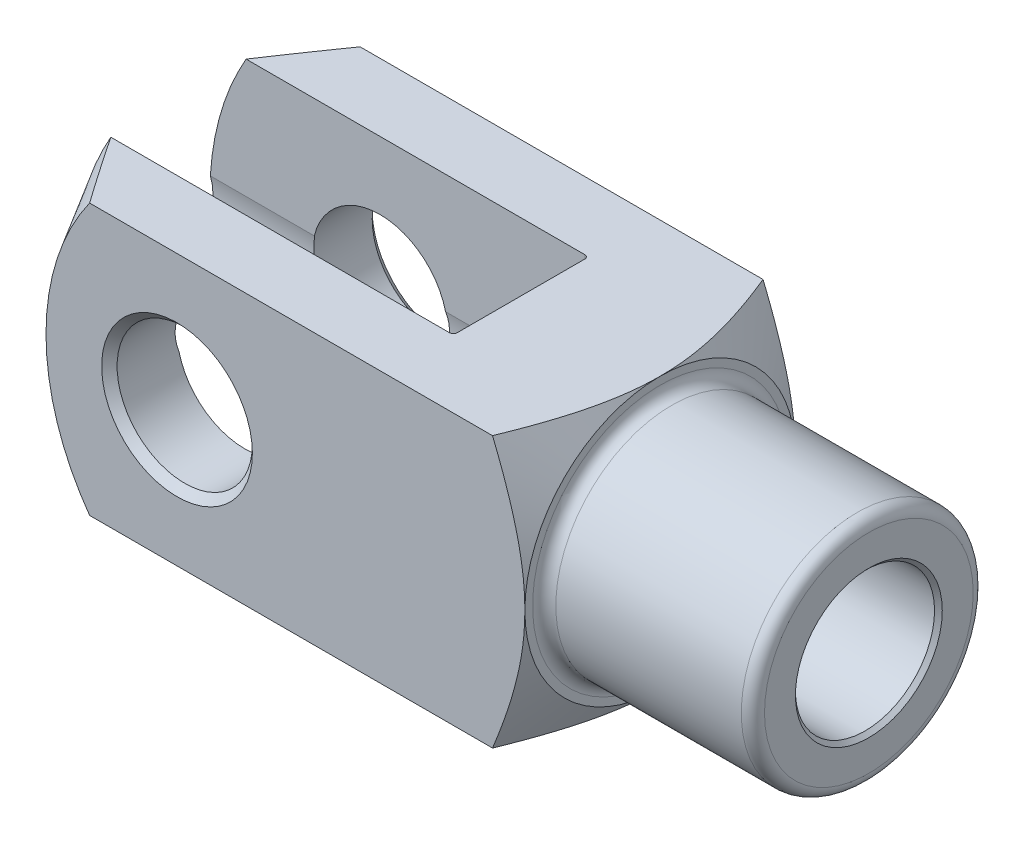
ISO-10303-21;
HEADER;
FILE_DESCRIPTION(('STEP AP214'),'2;1');
FILE_NAME('part.step','',(''),(''),'','','');
FILE_SCHEMA(('AUTOMOTIVE_DESIGN { 1 0 10303 214 1 1 1 1 }'));
ENDSEC;
DATA;
#1=APPLICATION_CONTEXT('core data for automotive mechanical design processes');
#2=APPLICATION_PROTOCOL_DEFINITION('international standard','automotive_design',2000,#1);
#3=PRODUCT_CONTEXT('',#1,'mechanical');
#4=PRODUCT('Part','Part','',(#3));
#5=PRODUCT_RELATED_PRODUCT_CATEGORY('part','',(#4));
#6=PRODUCT_DEFINITION_FORMATION('','',#4);
#7=PRODUCT_DEFINITION_CONTEXT('part definition',#1,'design');
#8=PRODUCT_DEFINITION('design','',#6,#7);
#9=PRODUCT_DEFINITION_SHAPE('','',#8);
#10=(LENGTH_UNIT() NAMED_UNIT(*) SI_UNIT(.MILLI.,.METRE.));
#11=(NAMED_UNIT(*) PLANE_ANGLE_UNIT() SI_UNIT($,.RADIAN.));
#12=(NAMED_UNIT(*) SI_UNIT($,.STERADIAN.) SOLID_ANGLE_UNIT());
#13=UNCERTAINTY_MEASURE_WITH_UNIT(LENGTH_MEASURE(1.E-05),#10,'distance_accuracy_value','');
#14=(GEOMETRIC_REPRESENTATION_CONTEXT(3) GLOBAL_UNCERTAINTY_ASSIGNED_CONTEXT((#13)) GLOBAL_UNIT_ASSIGNED_CONTEXT((#10,
#11,#12)) REPRESENTATION_CONTEXT('',''));
#15=CARTESIAN_POINT('',(0.,0.,0.));
#16=DIRECTION('',(0.,0.,1.));
#17=DIRECTION('',(1.,0.,0.));
#18=AXIS2_PLACEMENT_3D('',#15,#16,#17);
#19=CARTESIAN_POINT('',(-188.,-35.,-17.5));
#20=DIRECTION('',(0.,0.,-1.));
#21=DIRECTION('',(-1.,0.,0.));
#22=AXIS2_PLACEMENT_3D('',#19,#20,#21);
#23=PLANE('',#22);
#24=CARTESIAN_POINT('',(-118.,0.,-17.5));
#25=DIRECTION('',(0.,0.,1.));
#26=DIRECTION('',(1.,0.,0.));
#27=AXIS2_PLACEMENT_3D('',#24,#25,#26);
#28=CIRCLE('',#27,70.);
#29=CARTESIAN_POINT('',(-178.621778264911,35.,-17.5));
#30=VERTEX_POINT('',#29);
#31=CARTESIAN_POINT('',(-187.873099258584,4.21307488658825,-17.5));
#32=VERTEX_POINT('',#31);
#33=EDGE_CURVE('E217',#30,#32,#28,.T.);
#34=ORIENTED_EDGE('',*,*,#33,.T.);
#35=DIRECTION('',(1.,0.,0.));
#36=VECTOR('',#35,1.);
#37=CARTESIAN_POINT('',(-188.,4.21307488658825,-17.5));
#38=LINE('',#37,#36);
#39=CARTESIAN_POINT('',(-160.985287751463,4.21307488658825,-17.5));
#40=VERTEX_POINT('',#39);
#41=EDGE_CURVE('E192',#32,#40,#38,.T.);
#42=ORIENTED_EDGE('',*,*,#41,.T.);
#43=CARTESIAN_POINT('',(-144.,0.,-17.5));
#44=DIRECTION('',(0.,0.,-1.));
#45=DIRECTION('',(-1.,0.,0.));
#46=AXIS2_PLACEMENT_3D('',#43,#44,#45);
#47=CIRCLE('',#46,17.5);
#48=CARTESIAN_POINT('',(-127.014712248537,4.21307488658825,-17.5));
#49=VERTEX_POINT('',#48);
#50=EDGE_CURVE('E624',#49,#40,#47,.F.);
#51=ORIENTED_EDGE('',*,*,#50,.F.);
#52=CARTESIAN_POINT('',(-91.,4.21307488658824,-17.5));
#53=VERTEX_POINT('',#52);
#54=EDGE_CURVE('E324',#49,#53,#38,.T.);
#55=ORIENTED_EDGE('',*,*,#54,.T.);
#56=DIRECTION('',(0.,1.,0.));
#57=VECTOR('',#56,1.);
#58=CARTESIAN_POINT('',(-91.,35.,-17.5));
#59=LINE('',#58,#57);
#60=CARTESIAN_POINT('',(-91.,35.,-17.5));
#61=VERTEX_POINT('',#60);
#62=EDGE_CURVE('E422',#53,#61,#59,.T.);
#63=ORIENTED_EDGE('',*,*,#62,.T.);
#64=DIRECTION('',(-1.,0.,0.));
#65=VECTOR('',#64,1.);
#66=CARTESIAN_POINT('',(-188.,35.,-17.5));
#67=LINE('',#66,#65);
#68=EDGE_CURVE('E654',#61,#30,#67,.T.);
#69=ORIENTED_EDGE('',*,*,#68,.T.);
#70=EDGE_LOOP('',(#34,#42,#51,#55,#63,#69));
#71=FACE_BOUND('',#70,.T.);
#72=ADVANCED_FACE('F37',(#71),#23,.F.);
#73=CARTESIAN_POINT('',(-188.,-35.,17.5));
#74=DIRECTION('',(0.,0.,1.));
#75=DIRECTION('',(1.,0.,0.));
#76=AXIS2_PLACEMENT_3D('',#73,#74,#75);
#77=PLANE('',#76);
#78=CARTESIAN_POINT('',(-118.,0.,17.5));
#79=DIRECTION('',(0.,0.,1.));
#80=DIRECTION('',(1.,0.,0.));
#81=AXIS2_PLACEMENT_3D('',#78,#79,#80);
#82=CIRCLE('',#81,70.);
#83=CARTESIAN_POINT('',(-187.873099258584,-4.21307488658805,17.5));
#84=VERTEX_POINT('',#83);
#85=CARTESIAN_POINT('',(-178.621778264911,-35.,17.5));
#86=VERTEX_POINT('',#85);
#87=EDGE_CURVE('E934',#84,#86,#82,.T.);
#88=ORIENTED_EDGE('',*,*,#87,.F.);
#89=DIRECTION('',(1.,0.,0.));
#90=VECTOR('',#89,1.);
#91=CARTESIAN_POINT('',(-188.,-4.21307488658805,17.5));
#92=LINE('',#91,#90);
#93=CARTESIAN_POINT('',(-160.985287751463,-4.21307488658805,17.5));
#94=VERTEX_POINT('',#93);
#95=EDGE_CURVE('E61',#84,#94,#92,.T.);
#96=ORIENTED_EDGE('',*,*,#95,.T.);
#97=CARTESIAN_POINT('',(-144.,0.,17.5));
#98=DIRECTION('',(0.,0.,1.));
#99=DIRECTION('',(1.,0.,0.));
#100=AXIS2_PLACEMENT_3D('',#97,#98,#99);
#101=CIRCLE('',#100,17.5);
#102=CARTESIAN_POINT('',(-127.014712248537,-4.21307488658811,17.5));
#103=VERTEX_POINT('',#102);
#104=EDGE_CURVE('E621',#103,#94,#101,.F.);
#105=ORIENTED_EDGE('',*,*,#104,.F.);
#106=CARTESIAN_POINT('',(-91.,-4.21307488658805,17.5));
#107=VERTEX_POINT('',#106);
#108=EDGE_CURVE('E287',#103,#107,#92,.T.);
#109=ORIENTED_EDGE('',*,*,#108,.T.);
#110=DIRECTION('',(0.,1.,0.));
#111=VECTOR('',#110,1.);
#112=CARTESIAN_POINT('',(-91.,-35.,17.5));
#113=LINE('',#112,#111);
#114=CARTESIAN_POINT('',(-91.,-35.,17.5));
#115=VERTEX_POINT('',#114);
#116=EDGE_CURVE('E407',#107,#115,#113,.F.);
#117=ORIENTED_EDGE('',*,*,#116,.T.);
#118=DIRECTION('',(1.,0.,0.));
#119=VECTOR('',#118,1.);
#120=CARTESIAN_POINT('',(-188.,-35.,17.5));
#121=LINE('',#120,#119);
#122=EDGE_CURVE('E645',#86,#115,#121,.T.);
#123=ORIENTED_EDGE('',*,*,#122,.F.);
#124=EDGE_LOOP('',(#88,#96,#105,#109,#117,#123));
#125=FACE_BOUND('',#124,.T.);
#126=ADVANCED_FACE('F384',(#125),#77,.F.);
#127=CARTESIAN_POINT('',(-91.,-35.,-16.5));
#128=DIRECTION('',(0.,-1.,0.));
#129=DIRECTION('',(0.,0.,-1.));
#130=AXIS2_PLACEMENT_3D('',#127,#128,#129);
#131=CYLINDRICAL_SURFACE('',#130,1.);
#132=DIRECTION('',(0.,1.,0.));
#133=VECTOR('',#132,1.);
#134=CARTESIAN_POINT('',(-90.,-35.,-16.5));
#135=LINE('',#134,#133);
#136=CARTESIAN_POINT('',(-90.,-7.19374728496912,-16.5));
#137=VERTEX_POINT('',#136);
#138=CARTESIAN_POINT('',(-90.,-35.,-16.5));
#139=VERTEX_POINT('',#138);
#140=EDGE_CURVE('E614',#137,#139,#135,.F.);
#141=ORIENTED_EDGE('',*,*,#140,.F.);
#142=CARTESIAN_POINT('',(-90.,-7.19374728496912,-16.5));
#143=CARTESIAN_POINT('',(-90.0000131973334,-7.11650112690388,-16.5336792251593));
#144=CARTESIAN_POINT('',(-90.0017010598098,-7.039027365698,-16.5668099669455));
#145=CARTESIAN_POINT('',(-90.0081979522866,-6.88374477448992,-16.631931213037));
#146=CARTESIAN_POINT('',(-90.0130065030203,-6.80593599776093,-16.6639218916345));
#147=CARTESIAN_POINT('',(-90.0255252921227,-6.64997334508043,-16.7267729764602));
#148=CARTESIAN_POINT('',(-90.0332394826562,-6.57181914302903,-16.7576317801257));
#149=CARTESIAN_POINT('',(-90.0514330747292,-6.41537083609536,-16.8181466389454));
#150=CARTESIAN_POINT('',(-90.0619125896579,-6.33707672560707,-16.8478026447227));
#151=CARTESIAN_POINT('',(-90.0975002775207,-6.10110867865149,-16.9353095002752));
#152=CARTESIAN_POINT('',(-90.1266769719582,-5.94332461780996,-16.9913062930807));
#153=CARTESIAN_POINT('',(-90.1787390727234,-5.70728135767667,-17.0714338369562));
#154=CARTESIAN_POINT('',(-90.1974693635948,-5.62872826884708,-17.0974914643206));
#155=CARTESIAN_POINT('',(-90.2379230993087,-5.471973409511,-17.1483027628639));
#156=CARTESIAN_POINT('',(-90.2596461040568,-5.39377158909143,-17.17305662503));
#157=CARTESIAN_POINT('',(-90.3036354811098,-5.24742606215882,-17.2182941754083));
#158=CARTESIAN_POINT('',(-90.3255157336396,-5.17921383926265,-17.2389314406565));
#159=CARTESIAN_POINT('',(-90.3723270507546,-5.04361615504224,-17.2790891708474));
#160=CARTESIAN_POINT('',(-90.3972535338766,-4.97622961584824,-17.2986112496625));
#161=CARTESIAN_POINT('',(-90.4429187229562,-4.8627771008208,-17.3307748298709));
#162=CARTESIAN_POINT('',(-90.462660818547,-4.81639672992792,-17.3437192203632));
#163=CARTESIAN_POINT('',(-90.5045668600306,-4.7244442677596,-17.3689924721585));
#164=CARTESIAN_POINT('',(-90.5267351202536,-4.67887378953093,-17.3813201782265));
#165=CARTESIAN_POINT('',(-90.5750180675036,-4.58766965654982,-17.4056195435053));
#166=CARTESIAN_POINT('',(-90.6012408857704,-4.54208601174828,-17.4175650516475));
#167=CARTESIAN_POINT('',(-90.6584179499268,-4.45374001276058,-17.4403625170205));
#168=CARTESIAN_POINT('',(-90.6893539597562,-4.41096765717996,-17.4512184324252));
#169=CARTESIAN_POINT('',(-90.7382377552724,-4.35495179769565,-17.4652421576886));
#170=CARTESIAN_POINT('',(-90.7530557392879,-4.33919674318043,-17.4691617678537));
#171=CARTESIAN_POINT('',(-90.7843175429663,-4.30915314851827,-17.4765968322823));
#172=CARTESIAN_POINT('',(-90.8007657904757,-4.29486882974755,-17.4801111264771));
#173=CARTESIAN_POINT('',(-90.8358695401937,-4.26835902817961,-17.4866034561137));
#174=CARTESIAN_POINT('',(-90.8545594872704,-4.25617530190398,-17.4895706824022));
#175=CARTESIAN_POINT('',(-90.8939752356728,-4.23563034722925,-17.4945576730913));
#176=CARTESIAN_POINT('',(-90.9146820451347,-4.2272369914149,-17.4965854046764));
#177=CARTESIAN_POINT('',(-90.946488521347,-4.21879874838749,-17.4986212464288));
#178=CARTESIAN_POINT('',(-90.9570132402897,-4.21668135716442,-17.4991314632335));
#179=CARTESIAN_POINT('',(-90.9783511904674,-4.21380665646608,-17.4998238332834));
#180=CARTESIAN_POINT('',(-90.9891661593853,-4.21306166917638,-17.5000030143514));
#181=CARTESIAN_POINT('',(-90.9999999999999,-4.21307488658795,-17.5000000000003));
#182=B_SPLINE_CURVE_WITH_KNOTS('',3,(#142,#143,#144,#145,#146,#147,#148,#149,#150,#151,#152,
#153,#154,#155,#156,#157,#158,#159,#160,#161,#162,#163,#164,#165,#166,#167,#168,#169,#170,#171,
#172,#173,#174,#175,#176,#177,#178,#179,#180,#181),.UNSPECIFIED.,.F.,.F.,(4,2,2,2,2,2,2,2,2,2,2,
2,2,2,2,2,2,2,2,4),(0.,0.252772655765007,0.505506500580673,0.75858535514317,1.01167458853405,
1.52101108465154,1.77553281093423,2.0300171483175,2.25360699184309,2.47686460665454,
2.63294713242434,2.78931186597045,2.9509660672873,3.11200998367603,3.17787365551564,
3.24392139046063,3.31115976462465,3.37781700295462,3.40997218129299,3.44241468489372),.UNSPECIFIED.);
#183=CARTESIAN_POINT('',(-91.,-4.21307488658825,-17.5));
#184=VERTEX_POINT('',#183);
#185=EDGE_CURVE('E344',#137,#184,#182,.T.);
#186=ORIENTED_EDGE('',*,*,#185,.T.);
#187=CARTESIAN_POINT('',(-91.,-35.,-17.5));
#188=VERTEX_POINT('',#187);
#189=EDGE_CURVE('E428',#188,#184,#59,.T.);
#190=ORIENTED_EDGE('',*,*,#189,.F.);
#191=CARTESIAN_POINT('',(-91.,-35.,-16.5));
#192=DIRECTION('',(0.,-1.,0.));
#193=DIRECTION('',(0.,0.,-1.));
#194=AXIS2_PLACEMENT_3D('',#191,#192,#193);
#195=CIRCLE('',#194,1.);
#196=EDGE_CURVE('E439',#139,#188,#195,.F.);
#197=ORIENTED_EDGE('',*,*,#196,.F.);
#198=EDGE_LOOP('',(#141,#186,#190,#197));
#199=FACE_BOUND('',#198,.T.);
#200=ADVANCED_FACE('F363',(#199),#131,.F.);
#201=CARTESIAN_POINT('',(-90.,-35.,-17.5));
#202=DIRECTION('',(1.,0.,0.));
#203=DIRECTION('',(0.,0.,-1.));
#204=AXIS2_PLACEMENT_3D('',#201,#202,#203);
#205=PLANE('',#204);
#206=CARTESIAN_POINT('',(-90.,35.,-16.5));
#207=VERTEX_POINT('',#206);
#208=CARTESIAN_POINT('',(-90.,7.19374728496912,-16.5));
#209=VERTEX_POINT('',#208);
#210=EDGE_CURVE('E627',#207,#209,#135,.F.);
#211=ORIENTED_EDGE('',*,*,#210,.T.);
#212=CARTESIAN_POINT('',(-90.,0.,0.));
#213=DIRECTION('',(1.,0.,0.));
#214=DIRECTION('',(0.,0.,-1.));
#215=AXIS2_PLACEMENT_3D('',#212,#213,#214);
#216=CIRCLE('',#215,18.);
#217=CARTESIAN_POINT('',(-90.,7.19374728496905,16.5));
#218=VERTEX_POINT('',#217);
#219=EDGE_CURVE('E928',#209,#218,#216,.T.);
#220=ORIENTED_EDGE('',*,*,#219,.T.);
#221=DIRECTION('',(0.,1.,0.));
#222=VECTOR('',#221,1.);
#223=CARTESIAN_POINT('',(-90.,35.,16.5));
#224=LINE('',#223,#222);
#225=CARTESIAN_POINT('',(-90.,35.,16.5));
#226=VERTEX_POINT('',#225);
#227=EDGE_CURVE('E424',#218,#226,#224,.T.);
#228=ORIENTED_EDGE('',*,*,#227,.T.);
#229=DIRECTION('',(0.,0.,-1.));
#230=VECTOR('',#229,1.);
#231=CARTESIAN_POINT('',(-90.,35.,-17.5));
#232=LINE('',#231,#230);
#233=EDGE_CURVE('E648',#226,#207,#232,.T.);
#234=ORIENTED_EDGE('',*,*,#233,.T.);
#235=EDGE_LOOP('',(#211,#220,#228,#234));
#236=FACE_BOUND('',#235,.T.);
#237=ADVANCED_FACE('F398',(#236),#205,.F.);
#238=CARTESIAN_POINT('',(-91.,-35.,16.5));
#239=DIRECTION('',(0.,-1.,0.));
#240=DIRECTION('',(0.,0.,-1.));
#241=AXIS2_PLACEMENT_3D('',#238,#239,#240);
#242=CYLINDRICAL_SURFACE('',#241,1.);
#243=ORIENTED_EDGE('',*,*,#116,.F.);
#244=CARTESIAN_POINT('',(-91.,-4.21307488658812,17.5));
#245=CARTESIAN_POINT('',(-90.9829605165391,-4.21300539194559,17.5000159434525));
#246=CARTESIAN_POINT('',(-90.966041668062,-4.21488071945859,17.4995653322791));
#247=CARTESIAN_POINT('',(-90.9332135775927,-4.2218079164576,17.4978957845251));
#248=CARTESIAN_POINT('',(-90.9172915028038,-4.22680083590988,17.4966911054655));
#249=CARTESIAN_POINT('',(-90.8827128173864,-4.24086270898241,17.4932885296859));
#250=CARTESIAN_POINT('',(-90.8643720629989,-4.25063992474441,17.4909172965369));
#251=CARTESIAN_POINT('',(-90.8293871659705,-4.2728797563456,17.485497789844));
#252=CARTESIAN_POINT('',(-90.8127570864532,-4.28536235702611,17.4824444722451));
#253=CARTESIAN_POINT('',(-90.7666754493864,-4.32419460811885,17.4728937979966));
#254=CARTESIAN_POINT('',(-90.7393159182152,-4.35283241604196,17.4657893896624));
#255=CARTESIAN_POINT('',(-90.6886163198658,-4.41314085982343,17.4506496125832));
#256=CARTESIAN_POINT('',(-90.6652849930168,-4.44481786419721,17.4426122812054));
#257=CARTESIAN_POINT('',(-90.6241827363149,-4.50591953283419,17.426920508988));
#258=CARTESIAN_POINT('',(-90.6060808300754,-4.53514285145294,17.4193403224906));
#259=CARTESIAN_POINT('',(-90.5715900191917,-4.59448781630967,17.403781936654));
#260=CARTESIAN_POINT('',(-90.5552020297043,-4.62460993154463,17.3958035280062));
#261=CARTESIAN_POINT('',(-90.5080240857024,-4.71600474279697,17.3713347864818));
#262=CARTESIAN_POINT('',(-90.4792876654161,-4.77819895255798,17.3543383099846));
#263=CARTESIAN_POINT('',(-90.4254389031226,-4.90441873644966,17.3190941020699));
#264=CARTESIAN_POINT('',(-90.400359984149,-4.96845548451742,17.3008368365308));
#265=CARTESIAN_POINT('',(-90.3532834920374,-5.09727188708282,17.2633228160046));
#266=CARTESIAN_POINT('',(-90.3312826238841,-5.16205066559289,17.2440671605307));
#267=CARTESIAN_POINT('',(-90.284032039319,-5.3102506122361,17.1990927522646));
#268=CARTESIAN_POINT('',(-90.2595865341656,-5.39383430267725,17.1730687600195));
#269=CARTESIAN_POINT('',(-90.2142284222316,-5.56148672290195,17.1195097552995));
#270=CARTESIAN_POINT('',(-90.1933165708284,-5.6455555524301,17.0919744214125));
#271=CARTESIAN_POINT('',(-90.1547052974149,-5.81404572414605,17.035397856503));
#272=CARTESIAN_POINT('',(-90.1370099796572,-5.89846737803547,17.0063547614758));
#273=CARTESIAN_POINT('',(-90.1047361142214,-6.06739595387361,16.9468205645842));
#274=CARTESIAN_POINT('',(-90.0901575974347,-6.15190287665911,16.9163294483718));
#275=CARTESIAN_POINT('',(-90.06476976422,-6.31661868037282,16.8554929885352));
#276=CARTESIAN_POINT('',(-90.0538076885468,-6.39682984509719,16.8252175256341));
#277=CARTESIAN_POINT('',(-90.034773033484,-6.55710563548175,16.7634048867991));
#278=CARTESIAN_POINT('',(-90.0267003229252,-6.63717026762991,16.7318677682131));
#279=CARTESIAN_POINT('',(-90.013606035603,-6.79686678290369,16.6676329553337));
#280=CARTESIAN_POINT('',(-90.0085773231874,-6.87649924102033,16.634938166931));
#281=CARTESIAN_POINT('',(-90.0017814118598,-7.03541654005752,16.5683538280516));
#282=CARTESIAN_POINT('',(-90.0000147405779,-7.11470132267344,16.5344640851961));
#283=CARTESIAN_POINT('',(-90.,-7.19374728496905,16.5));
#284=B_SPLINE_CURVE_WITH_KNOTS('',3,(#244,#245,#246,#247,#248,#249,#250,#251,#252,#253,#254,
#255,#256,#257,#258,#259,#260,#261,#262,#263,#264,#265,#266,#267,#268,#269,#270,#271,#272,#273,
#274,#275,#276,#277,#278,#279,#280,#281,#282,#283),.UNSPECIFIED.,.F.,.F.,(4,2,2,2,2,2,2,2,2,2,2,
2,2,2,2,2,2,2,2,4),(0.,0.0508178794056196,0.100702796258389,0.163100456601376,0.225975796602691,
0.346025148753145,0.466331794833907,0.571859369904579,0.677443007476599,0.888996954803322,
1.10237697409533,1.31552679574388,1.58809983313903,1.86073106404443,2.13370776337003,
2.40668716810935,2.66592937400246,2.92515980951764,3.18378018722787,3.44244239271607),.UNSPECIFIED.);
#285=CARTESIAN_POINT('',(-90.,-7.19374728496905,16.5));
#286=VERTEX_POINT('',#285);
#287=EDGE_CURVE('E336',#107,#286,#284,.T.);
#288=ORIENTED_EDGE('',*,*,#287,.T.);
#289=CARTESIAN_POINT('',(-90.,-35.,16.5));
#290=VERTEX_POINT('',#289);
#291=EDGE_CURVE('E416',#290,#286,#224,.T.);
#292=ORIENTED_EDGE('',*,*,#291,.F.);
#293=CARTESIAN_POINT('',(-91.,-35.,16.5));
#294=DIRECTION('',(0.,-1.,0.));
#295=DIRECTION('',(0.,0.,-1.));
#296=AXIS2_PLACEMENT_3D('',#293,#294,#295);
#297=CIRCLE('',#296,1.);
#298=EDGE_CURVE('E410',#115,#290,#297,.F.);
#299=ORIENTED_EDGE('',*,*,#298,.F.);
#300=EDGE_LOOP('',(#243,#288,#292,#299));
#301=FACE_BOUND('',#300,.T.);
#302=ADVANCED_FACE('F354',(#301),#242,.F.);
#303=ORIENTED_EDGE('',*,*,#189,.T.);
#304=DIRECTION('',(1.,0.,0.));
#305=VECTOR('',#304,1.);
#306=CARTESIAN_POINT('',(-188.,-4.21307488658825,-17.5));
#307=LINE('',#306,#305);
#308=CARTESIAN_POINT('',(-127.014712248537,-4.21307488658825,-17.5));
#309=VERTEX_POINT('',#308);
#310=EDGE_CURVE('E211',#184,#309,#307,.F.);
#311=ORIENTED_EDGE('',*,*,#310,.T.);
#312=CARTESIAN_POINT('',(-160.985287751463,-4.21307488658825,-17.5));
#313=VERTEX_POINT('',#312);
#314=EDGE_CURVE('E208',#313,#309,#47,.F.);
#315=ORIENTED_EDGE('',*,*,#314,.F.);
#316=CARTESIAN_POINT('',(-187.873099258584,-4.21307488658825,-17.5));
#317=VERTEX_POINT('',#316);
#318=EDGE_CURVE('E189',#313,#317,#307,.F.);
#319=ORIENTED_EDGE('',*,*,#318,.T.);
#320=CARTESIAN_POINT('',(-178.621778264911,-35.,-17.5));
#321=VERTEX_POINT('',#320);
#322=EDGE_CURVE('E204',#317,#321,#28,.T.);
#323=ORIENTED_EDGE('',*,*,#322,.T.);
#324=DIRECTION('',(-1.,0.,0.));
#325=VECTOR('',#324,1.);
#326=CARTESIAN_POINT('',(-188.,-35.,-17.5));
#327=LINE('',#326,#325);
#328=EDGE_CURVE('E554',#188,#321,#327,.T.);
#329=ORIENTED_EDGE('',*,*,#328,.F.);
#330=EDGE_LOOP('',(#303,#311,#315,#319,#323,#329));
#331=FACE_BOUND('',#330,.T.);
#332=ADVANCED_FACE('F202',(#331),#23,.F.);
#333=CARTESIAN_POINT('',(-91.,35.,17.5));
#334=VERTEX_POINT('',#333);
#335=CARTESIAN_POINT('',(-91.,4.21307488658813,17.5));
#336=VERTEX_POINT('',#335);
#337=EDGE_CURVE('E415',#334,#336,#113,.F.);
#338=ORIENTED_EDGE('',*,*,#337,.T.);
#339=DIRECTION('',(1.,0.,0.));
#340=VECTOR('',#339,1.);
#341=CARTESIAN_POINT('',(-188.,4.21307488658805,17.5));
#342=LINE('',#341,#340);
#343=CARTESIAN_POINT('',(-127.014712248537,4.21307488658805,17.5));
#344=VERTEX_POINT('',#343);
#345=EDGE_CURVE('E53',#336,#344,#342,.F.);
#346=ORIENTED_EDGE('',*,*,#345,.T.);
#347=CARTESIAN_POINT('',(-160.985287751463,4.21307488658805,17.5));
#348=VERTEX_POINT('',#347);
#349=EDGE_CURVE('E625',#348,#344,#101,.F.);
#350=ORIENTED_EDGE('',*,*,#349,.F.);
#351=CARTESIAN_POINT('',(-187.873099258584,4.21307488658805,17.5));
#352=VERTEX_POINT('',#351);
#353=EDGE_CURVE('E274',#348,#352,#342,.F.);
#354=ORIENTED_EDGE('',*,*,#353,.T.);
#355=CARTESIAN_POINT('',(-178.621778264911,35.,17.5));
#356=VERTEX_POINT('',#355);
#357=EDGE_CURVE('E935',#356,#352,#82,.T.);
#358=ORIENTED_EDGE('',*,*,#357,.F.);
#359=DIRECTION('',(1.,0.,0.));
#360=VECTOR('',#359,1.);
#361=CARTESIAN_POINT('',(-188.,35.,17.5));
#362=LINE('',#361,#360);
#363=EDGE_CURVE('E651',#356,#334,#362,.T.);
#364=ORIENTED_EDGE('',*,*,#363,.T.);
#365=EDGE_LOOP('',(#338,#346,#350,#354,#358,#364));
#366=FACE_BOUND('',#365,.T.);
#367=ADVANCED_FACE('F390',(#366),#77,.F.);
#368=CARTESIAN_POINT('',(-188.,-35.,35.));
#369=DIRECTION('',(0.,0.,1.));
#370=DIRECTION('',(1.,0.,0.));
#371=AXIS2_PLACEMENT_3D('',#368,#369,#370);
#372=PLANE('',#371);
#373=CARTESIAN_POINT('',(-144.,0.,35.));
#374=DIRECTION('',(0.,0.,1.));
#375=DIRECTION('',(1.,0.,0.));
#376=AXIS2_PLACEMENT_3D('',#373,#374,#375);
#377=CIRCLE('',#376,19.5);
#378=CARTESIAN_POINT('',(-124.5,0.,35.));
#379=VERTEX_POINT('',#378);
#380=EDGE_CURVE('E470',#379,#379,#377,.F.);
#381=ORIENTED_EDGE('',*,*,#380,.T.);
#382=EDGE_LOOP('',(#381));
#383=FACE_BOUND('',#382,.T.);
#384=DIRECTION('',(1.,0.,0.));
#385=VECTOR('',#384,1.);
#386=CARTESIAN_POINT('',(-188.,35.,35.));
#387=LINE('',#386,#385);
#388=CARTESIAN_POINT('',(-166.606328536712,35.,35.));
#389=VERTEX_POINT('',#388);
#390=CARTESIAN_POINT('',(-62.3701209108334,35.,35.));
#391=VERTEX_POINT('',#390);
#392=EDGE_CURVE('E593',#389,#391,#387,.T.);
#393=ORIENTED_EDGE('',*,*,#392,.F.);
#394=CARTESIAN_POINT('',(-118.,0.,35.));
#395=DIRECTION('',(0.,0.,1.));
#396=DIRECTION('',(1.,0.,0.));
#397=AXIS2_PLACEMENT_3D('',#394,#395,#396);
#398=CIRCLE('',#397,59.8963702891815);
#399=CARTESIAN_POINT('',(-166.606328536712,-35.,35.));
#400=VERTEX_POINT('',#399);
#401=EDGE_CURVE('E225',#389,#400,#398,.T.);
#402=ORIENTED_EDGE('',*,*,#401,.T.);
#403=DIRECTION('',(1.,0.,0.));
#404=VECTOR('',#403,1.);
#405=CARTESIAN_POINT('',(-188.,-35.,35.));
#406=LINE('',#405,#404);
#407=CARTESIAN_POINT('',(-62.3701209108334,-35.,35.));
#408=VERTEX_POINT('',#407);
#409=EDGE_CURVE('E600',#400,#408,#406,.T.);
#410=ORIENTED_EDGE('',*,*,#409,.T.);
#411=CARTESIAN_POINT('',(-79.7455571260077,-71.4841524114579,35.));
#412=CARTESIAN_POINT('',(-79.298335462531,-70.6216687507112,35.));
#413=CARTESIAN_POINT('',(-78.8523395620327,-69.7585498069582,35.));
#414=CARTESIAN_POINT('',(-77.9630613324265,-68.0309117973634,35.));
#415=CARTESIAN_POINT('',(-77.5197790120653,-67.1663927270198,35.));
#416=CARTESIAN_POINT('',(-76.1943552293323,-64.5704620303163,35.));
#417=CARTESIAN_POINT('',(-75.3166821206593,-62.8367639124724,35.));
#418=CARTESIAN_POINT('',(-73.5744168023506,-59.3590234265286,35.));
#419=CARTESIAN_POINT('',(-72.7098500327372,-57.6149683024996,35.));
#420=CARTESIAN_POINT('',(-70.9988898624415,-54.1179792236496,35.));
#421=CARTESIAN_POINT('',(-70.152496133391,-52.3650454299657,35.));
#422=CARTESIAN_POINT('',(-68.8743862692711,-49.673396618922,35.));
#423=CARTESIAN_POINT('',(-68.4344483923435,-48.73858362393,35.));
#424=CARTESIAN_POINT('',(-67.5619188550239,-46.865537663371,35.));
#425=CARTESIAN_POINT('',(-67.1293271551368,-45.9273047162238,35.));
#426=CARTESIAN_POINT('',(-66.2724882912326,-44.0469670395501,35.));
#427=CARTESIAN_POINT('',(-65.8482416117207,-43.1048620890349,35.));
#428=CARTESIAN_POINT('',(-65.0093315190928,-41.2163859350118,35.));
#429=CARTESIAN_POINT('',(-64.594668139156,-40.2700147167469,35.));
#430=CARTESIAN_POINT('',(-63.7765361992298,-38.3729279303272,35.));
#431=CARTESIAN_POINT('',(-63.3730628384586,-37.4222144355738,35.));
#432=CARTESIAN_POINT('',(-62.5788187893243,-35.5154994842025,35.));
#433=CARTESIAN_POINT('',(-62.1880479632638,-34.5594980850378,35.));
#434=CARTESIAN_POINT('',(-61.4212481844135,-32.6417187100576,35.));
#435=CARTESIAN_POINT('',(-61.0452174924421,-31.6799414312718,35.));
#436=CARTESIAN_POINT('',(-60.3101986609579,-29.7498374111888,35.));
#437=CARTESIAN_POINT('',(-59.9512112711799,-28.781510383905,35.));
#438=CARTESIAN_POINT('',(-59.1773660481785,-26.6269700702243,35.));
#439=CARTESIAN_POINT('',(-58.7672704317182,-25.4390360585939,35.));
#440=CARTESIAN_POINT('',(-57.9823694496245,-23.0516177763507,35.));
#441=CARTESIAN_POINT('',(-57.6075610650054,-21.8521345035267,35.));
#442=CARTESIAN_POINT('',(-56.9001918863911,-19.4407071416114,35.));
#443=CARTESIAN_POINT('',(-56.5676302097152,-18.2287633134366,35.));
#444=CARTESIAN_POINT('',(-55.9526962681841,-15.79212691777,35.));
#445=CARTESIAN_POINT('',(-55.6703234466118,-14.567434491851,35.));
#446=CARTESIAN_POINT('',(-55.1702230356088,-12.1346782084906,35.));
#447=CARTESIAN_POINT('',(-54.9511335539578,-10.926898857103,35.));
#448=CARTESIAN_POINT('',(-54.6702587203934,-9.10791584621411,35.));
#449=CARTESIAN_POINT('',(-54.5845910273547,-8.50034299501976,35.));
#450=CARTESIAN_POINT('',(-54.4300119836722,-7.28307909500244,35.));
#451=CARTESIAN_POINT('',(-54.3610998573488,-6.67338814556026,35.));
#452=CARTESIAN_POINT('',(-54.2408047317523,-5.45265711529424,35.));
#453=CARTESIAN_POINT('',(-54.1894109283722,-4.84161810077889,35.));
#454=CARTESIAN_POINT('',(-54.1046686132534,-3.61828422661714,35.));
#455=CARTESIAN_POINT('',(-54.0713201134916,-3.00598936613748,35.));
#456=CARTESIAN_POINT('',(-54.0230583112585,-1.78068731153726,35.));
#457=CARTESIAN_POINT('',(-54.0081445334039,-1.16768013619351,35.));
#458=CARTESIAN_POINT('',(-53.9969287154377,0.0585026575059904,35.));
#459=CARTESIAN_POINT('',(-54.0006265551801,0.671678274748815,35.));
#460=CARTESIAN_POINT('',(-54.0256414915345,1.85294442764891,35.));
#461=CARTESIAN_POINT('',(-54.0456545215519,2.42106307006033,35.));
#462=CARTESIAN_POINT('',(-54.1014333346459,3.55654632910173,35.));
#463=CARTESIAN_POINT('',(-54.1371997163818,4.12391091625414,35.));
#464=CARTESIAN_POINT('',(-54.2241302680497,5.25742922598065,35.));
#465=CARTESIAN_POINT('',(-54.2752936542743,5.82358300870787,35.));
#466=CARTESIAN_POINT('',(-54.3925261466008,6.95435287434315,35.));
#467=CARTESIAN_POINT('',(-54.4585958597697,7.51896889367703,35.));
#468=CARTESIAN_POINT('',(-54.6783609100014,9.21054236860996,35.));
#469=CARTESIAN_POINT('',(-54.8535756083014,10.3347599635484,35.));
#470=CARTESIAN_POINT('',(-55.2556333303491,12.5738033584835,35.));
#471=CARTESIAN_POINT('',(-55.4824777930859,13.688628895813,35.));
#472=CARTESIAN_POINT('',(-55.9887006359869,15.94014365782,35.));
#473=CARTESIAN_POINT('',(-56.2694095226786,17.0765317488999,35.));
#474=CARTESIAN_POINT('',(-56.8720367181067,19.3382710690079,35.));
#475=CARTESIAN_POINT('',(-57.193955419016,20.4636221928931,35.));
#476=CARTESIAN_POINT('',(-57.7030697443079,22.1435871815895,35.));
#477=CARTESIAN_POINT('',(-57.8771454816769,22.7022267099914,35.));
#478=CARTESIAN_POINT('',(-58.2333547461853,23.8169352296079,35.));
#479=CARTESIAN_POINT('',(-58.4154882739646,24.3730042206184,35.));
#480=CARTESIAN_POINT('',(-58.7871408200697,25.4826284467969,35.));
#481=CARTESIAN_POINT('',(-58.9766594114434,26.0361838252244,35.));
#482=CARTESIAN_POINT('',(-59.362488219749,27.1409163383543,35.));
#483=CARTESIAN_POINT('',(-59.5587984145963,27.6920934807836,35.));
#484=CARTESIAN_POINT('',(-60.1895678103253,29.4318816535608,35.));
#485=CARTESIAN_POINT('',(-60.6354807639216,30.6163513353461,35.));
#486=CARTESIAN_POINT('',(-61.5515172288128,32.9759195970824,35.));
#487=CARTESIAN_POINT('',(-62.0216421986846,34.1510176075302,35.));
#488=CARTESIAN_POINT('',(-62.982193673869,36.4931780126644,35.));
#489=CARTESIAN_POINT('',(-63.4726247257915,37.6602385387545,35.));
#490=CARTESIAN_POINT('',(-64.4704100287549,39.9870590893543,35.));
#491=CARTESIAN_POINT('',(-64.9777639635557,41.1468192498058,35.));
#492=CARTESIAN_POINT('',(-66.0071895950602,43.4609776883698,35.));
#493=CARTESIAN_POINT('',(-66.5292736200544,44.6153704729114,35.));
#494=CARTESIAN_POINT('',(-67.5855656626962,46.9185930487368,35.));
#495=CARTESIAN_POINT('',(-68.1197737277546,48.0674228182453,35.));
#496=CARTESIAN_POINT('',(-69.1984683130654,50.3600825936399,35.));
#497=CARTESIAN_POINT('',(-69.7429536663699,51.5039131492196,35.));
#498=CARTESIAN_POINT('',(-70.8407931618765,53.787303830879,35.));
#499=CARTESIAN_POINT('',(-71.3941472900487,54.9268639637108,35.));
#500=CARTESIAN_POINT('',(-72.5102077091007,57.2056982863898,35.));
#501=CARTESIAN_POINT('',(-73.0729373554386,58.3449610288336,35.));
#502=CARTESIAN_POINT('',(-74.2050779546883,60.6201599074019,35.));
#503=CARTESIAN_POINT('',(-74.7744889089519,61.7560960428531,35.));
#504=CARTESIAN_POINT('',(-75.9191479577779,64.0250497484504,35.));
#505=CARTESIAN_POINT('',(-76.494396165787,65.1580672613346,35.));
#506=CARTESIAN_POINT('',(-77.6500048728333,67.4214931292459,35.));
#507=CARTESIAN_POINT('',(-78.2303653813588,68.5519014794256,35.));
#508=CARTESIAN_POINT('',(-79.9775989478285,71.938533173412,35.));
#509=CARTESIAN_POINT('',(-81.1511939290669,74.191289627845,35.));
#510=CARTESIAN_POINT('',(-83.5124380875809,78.6893897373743,35.));
#511=CARTESIAN_POINT('',(-84.7000871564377,80.9347334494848,35.));
#512=CARTESIAN_POINT('',(-86.9094378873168,85.0864160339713,35.));
#513=CARTESIAN_POINT('',(-87.9295909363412,86.9935796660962,35.));
#514=CARTESIAN_POINT('',(-89.9767304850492,90.8042363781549,35.));
#515=CARTESIAN_POINT('',(-91.0037169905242,92.7077294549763,35.));
#516=CARTESIAN_POINT('',(-93.063598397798,96.5118602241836,35.));
#517=CARTESIAN_POINT('',(-94.0964941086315,98.4124974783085,35.));
#518=CARTESIAN_POINT('',(-96.1671930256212,102.211097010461,35.));
#519=CARTESIAN_POINT('',(-97.2049962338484,104.109059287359,35.));
#520=CARTESIAN_POINT('',(-99.2788542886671,107.891810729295,35.));
#521=CARTESIAN_POINT('',(-100.314885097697,109.776613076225,35.));
#522=CARTESIAN_POINT('',(-102.390544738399,113.544235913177,35.));
#523=CARTESIAN_POINT('',(-103.430173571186,115.427056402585,35.));
#524=CARTESIAN_POINT('',(-105.51239361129,119.190669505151,35.));
#525=CARTESIAN_POINT('',(-106.55498432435,121.071462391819,35.));
#526=CARTESIAN_POINT('',(-108.642913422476,124.831519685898,35.));
#527=CARTESIAN_POINT('',(-109.68825180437,126.71078409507,35.));
#528=CARTESIAN_POINT('',(-110.734776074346,128.589387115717,35.));
#529=B_SPLINE_CURVE_WITH_KNOTS('',3,(#411,#412,#413,#414,#415,#416,#417,#418,#419,#420,#421,
#422,#423,#424,#425,#426,#427,#428,#429,#430,#431,#432,#433,#434,#435,#436,#437,#438,#439,#440,
#441,#442,#443,#444,#445,#446,#447,#448,#449,#450,#451,#452,#453,#454,#455,#456,#457,#458,#459,
#460,#461,#462,#463,#464,#465,#466,#467,#468,#469,#470,#471,#472,#473,#474,#475,#476,#477,#478,
#479,#480,#481,#482,#483,#484,#485,#486,#487,#488,#489,#490,#491,#492,#493,#494,#495,#496,#497,
#498,#499,#500,#501,#502,#503,#504,#505,#506,#507,#508,#509,#510,#511,#512,#513,#514,#515,#516,
#517,#518,#519,#520,#521,#522,#523,#524,#525,#526,#527,#528),.UNSPECIFIED.,.F.,.F.,(4,2,2,2,2,2,
2,2,2,2,2,2,2,2,2,2,2,2,2,2,2,2,2,2,2,2,2,2,2,2,2,2,2,2,2,2,2,2,2,2,2,2,2,2,2,2,2,2,2,2,2,2,2,2,
2,2,2,2,4),(0.,2.91461071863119,5.82923082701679,11.6587651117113,17.4984507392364,
23.3380307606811,26.4374866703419,29.5369259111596,32.6365445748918,35.7361739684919,
38.8344523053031,41.9326970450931,45.0305751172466,48.128589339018,51.8983063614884,
55.6677005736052,59.4370160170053,63.206289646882,66.8870829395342,68.7276372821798,
70.5681064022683,72.4074383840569,74.2467715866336,76.0860573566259,77.9253312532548,
79.6305250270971,81.3357836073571,83.0409554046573,84.7461966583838,88.1580776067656,
91.5700536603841,95.0807863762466,98.5915525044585,100.346902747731,102.102253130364,
103.857502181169,105.6127455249,109.409260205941,113.206003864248,117.003602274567,
120.801129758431,124.601935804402,128.402756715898,132.203148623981,136.003534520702,
139.815498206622,143.627462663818,147.439501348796,151.251547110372,158.871851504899,
166.492097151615,172.980676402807,179.469261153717,185.958756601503,192.448254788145,
198.900579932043,205.352907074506,211.80421426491,218.255514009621),.UNSPECIFIED.);
#530=CARTESIAN_POINT('',(-54.,0.,35.));
#531=VERTEX_POINT('',#530);
#532=EDGE_CURVE('E565',#531,#408,#529,.F.);
#533=ORIENTED_EDGE('',*,*,#532,.F.);
#534=EDGE_CURVE('E575',#391,#531,#529,.F.);
#535=ORIENTED_EDGE('',*,*,#534,.F.);
#536=EDGE_LOOP('',(#393,#402,#410,#533,#535));
#537=FACE_BOUND('',#536,.T.);
#538=ADVANCED_FACE('F396',(#383,#537),#372,.T.);
#539=CARTESIAN_POINT('',(-188.,-35.,35.));
#540=DIRECTION('',(0.,-1.,0.));
#541=DIRECTION('',(0.,0.,-1.));
#542=AXIS2_PLACEMENT_3D('',#539,#540,#541);
#543=PLANE('',#542);
#544=ORIENTED_EDGE('',*,*,#328,.T.);
#545=CARTESIAN_POINT('',(-206.312353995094,-35.,25.7928090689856));
#546=CARTESIAN_POINT('',(-205.46093170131,-35.,24.4218524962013));
#547=CARTESIAN_POINT('',(-204.60830989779,-35.,23.0516410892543));
#548=CARTESIAN_POINT('',(-202.90044041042,-35.,20.3128537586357));
#549=CARTESIAN_POINT('',(-202.045192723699,-35.,18.9442778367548));
#550=CARTESIAN_POINT('',(-199.475140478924,-35.,14.8411730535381));
#551=CARTESIAN_POINT('',(-197.756059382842,-35.,12.1093197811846));
#552=CARTESIAN_POINT('',(-194.302192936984,-35.,6.65098799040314));
#553=CARTESIAN_POINT('',(-192.567391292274,-35.,3.92451977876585));
#554=CARTESIAN_POINT('',(-189.081229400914,-35.,-1.51779201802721));
#555=CARTESIAN_POINT('',(-187.329869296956,-35.,-4.23363569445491));
#556=CARTESIAN_POINT('',(-184.650874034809,-35.,-8.3538141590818));
#557=CARTESIAN_POINT('',(-183.730674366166,-35.,-9.76298514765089));
#558=CARTESIAN_POINT('',(-181.884053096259,-35.,-12.5772433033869));
#559=CARTESIAN_POINT('',(-180.95763150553,-35.,-13.982330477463));
#560=CARTESIAN_POINT('',(-179.097759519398,-35.,-16.7879000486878));
#561=CARTESIAN_POINT('',(-178.164308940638,-35.,-18.1883823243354));
#562=CARTESIAN_POINT('',(-176.289475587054,-35.,-20.9840286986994));
#563=CARTESIAN_POINT('',(-175.348092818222,-35.,-22.3791928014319));
#564=CARTESIAN_POINT('',(-173.457008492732,-35.,-25.1623339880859));
#565=CARTESIAN_POINT('',(-172.507313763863,-35.,-26.5503157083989));
#566=CARTESIAN_POINT('',(-170.59758377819,-35.,-29.3191598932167));
#567=CARTESIAN_POINT('',(-169.637548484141,-35.,-30.7000223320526));
#568=CARTESIAN_POINT('',(-167.705593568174,-35.,-33.4533209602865));
#569=CARTESIAN_POINT('',(-166.733674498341,-35.,-34.8257575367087));
#570=CARTESIAN_POINT('',(-164.775975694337,-35.,-37.5606976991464));
#571=CARTESIAN_POINT('',(-163.790196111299,-35.,-38.9232013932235));
#572=CARTESIAN_POINT('',(-161.811627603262,-35.,-41.6236660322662));
#573=CARTESIAN_POINT('',(-160.818989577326,-35.,-42.9617373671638));
#574=CARTESIAN_POINT('',(-158.814814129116,-35.,-45.6237098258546));
#575=CARTESIAN_POINT('',(-157.803276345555,-35.,-46.9476106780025));
#576=CARTESIAN_POINT('',(-155.756239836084,-35.,-49.5797398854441));
#577=CARTESIAN_POINT('',(-154.720710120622,-35.,-50.8879442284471));
#578=CARTESIAN_POINT('',(-153.146926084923,-35.,-52.8336277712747));
#579=CARTESIAN_POINT('',(-152.618924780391,-35.,-53.4794086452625));
#580=CARTESIAN_POINT('',(-151.555349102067,-35.,-54.7646990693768));
#581=CARTESIAN_POINT('',(-151.019774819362,-35.,-55.4042086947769));
#582=CARTESIAN_POINT('',(-149.945822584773,-35.,-56.6695237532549));
#583=CARTESIAN_POINT('',(-149.407531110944,-35.,-57.2954025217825));
#584=CARTESIAN_POINT('',(-148.321810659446,-35.,-58.5391977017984));
#585=CARTESIAN_POINT('',(-147.774381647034,-35.,-59.1571140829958));
#586=CARTESIAN_POINT('',(-146.669189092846,-35.,-60.3839547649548));
#587=CARTESIAN_POINT('',(-146.111422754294,-35.,-60.9928765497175));
#588=CARTESIAN_POINT('',(-144.984500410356,-35.,-62.2000945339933));
#589=CARTESIAN_POINT('',(-144.415344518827,-35.,-62.7983908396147));
#590=CARTESIAN_POINT('',(-143.265535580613,-35.,-63.9812569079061));
#591=CARTESIAN_POINT('',(-142.68491107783,-35.,-64.5658543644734));
#592=CARTESIAN_POINT('',(-141.509320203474,-35.,-65.7205393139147));
#593=CARTESIAN_POINT('',(-140.914353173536,-35.,-66.2906261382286));
#594=CARTESIAN_POINT('',(-139.708631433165,-35.,-67.4132046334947));
#595=CARTESIAN_POINT('',(-139.097885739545,-35.,-67.9657059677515));
#596=CARTESIAN_POINT('',(-137.858303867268,-35.,-69.0499566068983));
#597=CARTESIAN_POINT('',(-137.229470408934,-35.,-69.5817090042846));
#598=CARTESIAN_POINT('',(-136.259534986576,-35.,-70.3697594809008));
#599=CARTESIAN_POINT('',(-135.925886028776,-35.,-70.6352530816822));
#600=CARTESIAN_POINT('',(-135.252770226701,-35.,-71.158774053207));
#601=CARTESIAN_POINT('',(-134.913303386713,-35.,-71.4168014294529));
#602=CARTESIAN_POINT('',(-134.228136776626,-35.,-71.9246252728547));
#603=CARTESIAN_POINT('',(-133.882435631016,-35.,-72.1744198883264));
#604=CARTESIAN_POINT('',(-133.184549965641,-35.,-72.6647652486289));
#605=CARTESIAN_POINT('',(-132.832365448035,-35.,-72.9053159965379));
#606=CARTESIAN_POINT('',(-131.766128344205,-35.,-73.6111998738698));
#607=CARTESIAN_POINT('',(-131.041792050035,-35.,-74.0612138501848));
#608=CARTESIAN_POINT('',(-129.563729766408,-35.,-74.9101604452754));
#609=CARTESIAN_POINT('',(-128.810011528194,-35.,-75.3091064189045));
#610=CARTESIAN_POINT('',(-127.447705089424,-35.,-75.9597849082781));
#611=CARTESIAN_POINT('',(-126.845258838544,-35.,-76.2243344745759));
#612=CARTESIAN_POINT('',(-125.622728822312,-35.,-76.7092404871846));
#613=CARTESIAN_POINT('',(-125.002646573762,-35.,-76.9296007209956));
#614=CARTESIAN_POINT('',(-123.747412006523,-35.,-77.3191580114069));
#615=CARTESIAN_POINT('',(-123.112281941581,-35.,-77.4884260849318));
#616=CARTESIAN_POINT('',(-121.829402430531,-35.,-77.7699622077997));
#617=CARTESIAN_POINT('',(-121.181653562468,-35.,-77.8822328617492));
#618=CARTESIAN_POINT('',(-119.871819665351,-35.,-78.0457889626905));
#619=CARTESIAN_POINT('',(-119.209656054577,-35.,-78.0964535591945));
#620=CARTESIAN_POINT('',(-117.883564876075,-35.,-78.1323179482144));
#621=CARTESIAN_POINT('',(-117.219637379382,-35.,-78.1175203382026));
#622=CARTESIAN_POINT('',(-115.896318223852,-35.,-78.0231748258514));
#623=CARTESIAN_POINT('',(-115.236927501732,-35.,-77.9436139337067));
#624=CARTESIAN_POINT('',(-113.928474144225,-35.,-77.7234055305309));
#625=CARTESIAN_POINT('',(-113.279413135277,-35.,-77.5827484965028));
#626=CARTESIAN_POINT('',(-111.876970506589,-35.,-77.2148758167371));
#627=CARTESIAN_POINT('',(-111.126540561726,-35.,-76.9764514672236));
#628=CARTESIAN_POINT('',(-109.650289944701,-35.,-76.4331266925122));
#629=CARTESIAN_POINT('',(-108.924476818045,-35.,-76.1282060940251));
#630=CARTESIAN_POINT('',(-107.496631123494,-35.,-75.4621277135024));
#631=CARTESIAN_POINT('',(-106.794677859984,-35.,-75.1008012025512));
#632=CARTESIAN_POINT('',(-105.761078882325,-35.,-74.5247542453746));
#633=CARTESIAN_POINT('',(-105.419769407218,-35.,-74.3270634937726));
#634=CARTESIAN_POINT('',(-104.743315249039,-35.,-73.9213611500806));
#635=CARTESIAN_POINT('',(-104.408170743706,-35.,-73.7133492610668));
#636=CARTESIAN_POINT('',(-103.634953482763,-35.,-73.2182970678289));
#637=CARTESIAN_POINT('',(-103.199155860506,-35.,-72.9277040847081));
#638=CARTESIAN_POINT('',(-102.337475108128,-35.,-72.3321403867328));
#639=CARTESIAN_POINT('',(-101.911593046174,-35.,-72.0271681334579));
#640=CARTESIAN_POINT('',(-100.647575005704,-35.,-71.0931751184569));
#641=CARTESIAN_POINT('',(-99.8233553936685,-35.,-70.4452655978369));
#642=CARTESIAN_POINT('',(-98.205750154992,-35.,-69.1093767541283));
#643=CARTESIAN_POINT('',(-97.4124264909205,-35.,-68.421323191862));
#644=CARTESIAN_POINT('',(-95.8537570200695,-35.,-67.0146117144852));
#645=CARTESIAN_POINT('',(-95.0884063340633,-35.,-66.2959591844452));
#646=CARTESIAN_POINT('',(-93.5765663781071,-35.,-64.8292244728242));
#647=CARTESIAN_POINT('',(-92.830237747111,-35.,-64.0809774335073));
#648=CARTESIAN_POINT('',(-91.3583812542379,-35.,-62.564305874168));
#649=CARTESIAN_POINT('',(-90.6328541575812,-35.,-61.7958806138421));
#650=CARTESIAN_POINT('',(-89.2005334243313,-35.,-60.2432827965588));
#651=CARTESIAN_POINT('',(-88.4937211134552,-35.,-59.4591274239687));
#652=CARTESIAN_POINT('',(-87.0957066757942,-35.,-57.8770827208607));
#653=CARTESIAN_POINT('',(-86.4045042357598,-35.,-57.0791936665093));
#654=CARTESIAN_POINT('',(-84.7519882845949,-35.,-55.1387156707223));
#655=CARTESIAN_POINT('',(-83.7974740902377,-35.,-53.9903390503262));
#656=CARTESIAN_POINT('',(-81.9109111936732,-35.,-51.6749671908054));
#657=CARTESIAN_POINT('',(-80.9788669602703,-35.,-50.5079683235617));
#658=CARTESIAN_POINT('',(-79.1479834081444,-35.,-48.17700765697));
#659=CARTESIAN_POINT('',(-78.2488541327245,-35.,-47.0132733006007));
#660=CARTESIAN_POINT('',(-76.9121210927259,-35.,-45.258860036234));
#661=CARTESIAN_POINT('',(-76.4686013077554,-35.,-44.6726739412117));
#662=CARTESIAN_POINT('',(-75.5852226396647,-35.,-43.4975581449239));
#663=CARTESIAN_POINT('',(-75.145363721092,-35.,-42.9086284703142));
#664=CARTESIAN_POINT('',(-74.7071909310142,-35.,-42.3184459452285));
#665=B_SPLINE_CURVE_WITH_KNOTS('',3,(#545,#546,#547,#548,#549,#550,#551,#552,#553,#554,#555,
#556,#557,#558,#559,#560,#561,#562,#563,#564,#565,#566,#567,#568,#569,#570,#571,#572,#573,#574,
#575,#576,#577,#578,#579,#580,#581,#582,#583,#584,#585,#586,#587,#588,#589,#590,#591,#592,#593,
#594,#595,#596,#597,#598,#599,#600,#601,#602,#603,#604,#605,#606,#607,#608,#609,#610,#611,#612,
#613,#614,#615,#616,#617,#618,#619,#620,#621,#622,#623,#624,#625,#626,#627,#628,#629,#630,#631,
#632,#633,#634,#635,#636,#637,#638,#639,#640,#641,#642,#643,#644,#645,#646,#647,#648,#649,#650,
#651,#652,#653,#654,#655,#656,#657,#658,#659,#660,#661,#662,#663,#664),.UNSPECIFIED.,.F.,.F.,(4,
2,2,2,2,2,2,2,2,2,2,2,2,2,2,2,2,2,2,2,2,2,2,2,2,2,2,2,2,2,2,2,2,2,2,2,2,2,2,2,2,2,2,2,2,2,2,2,2,
2,2,2,2,2,2,2,2,2,2,4),(0.,4.84148368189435,9.68297265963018,19.3661363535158,29.0608574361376,
38.7554950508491,43.8045185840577,48.8535335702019,53.9026807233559,58.9518240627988,
63.9971498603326,69.0424938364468,74.0876043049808,79.1326598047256,84.1307063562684,
89.1288485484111,94.1338527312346,96.636277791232,99.1386727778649,101.615152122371,
104.091640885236,106.568809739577,109.045953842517,111.517560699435,113.98928122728,
116.459619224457,118.929587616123,120.208670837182,121.48775311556,122.76712114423,
124.046488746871,126.602978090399,129.15879751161,131.131243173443,133.103519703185,
135.073042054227,137.042474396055,139.031593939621,141.020634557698,143.010074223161,
144.999824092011,147.35821715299,149.717326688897,152.083633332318,153.266774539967,
154.449949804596,156.020998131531,157.592214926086,160.735678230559,163.885151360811,
167.034072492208,170.204081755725,173.374207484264,176.541040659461,179.707810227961,
184.187254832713,188.667583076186,193.079262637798,195.284453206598,197.489622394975),.UNSPECIFIED.);
#666=CARTESIAN_POINT('',(-166.606328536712,-35.,-35.));
#667=VERTEX_POINT('',#666);
#668=EDGE_CURVE('E214',#321,#667,#665,.T.);
#669=ORIENTED_EDGE('',*,*,#668,.T.);
#670=DIRECTION('',(1.,0.,0.));
#671=VECTOR('',#670,1.);
#672=CARTESIAN_POINT('',(-188.,-35.,-35.));
#673=LINE('',#672,#671);
#674=CARTESIAN_POINT('',(-62.3701209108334,-35.,-35.));
#675=VERTEX_POINT('',#674);
#676=EDGE_CURVE('E607',#667,#675,#673,.T.);
#677=ORIENTED_EDGE('',*,*,#676,.T.);
#678=CARTESIAN_POINT('',(-79.7455571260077,-35.,-71.4841524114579));
#679=CARTESIAN_POINT('',(-79.298335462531,-35.,-70.6216687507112));
#680=CARTESIAN_POINT('',(-78.8523395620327,-35.,-69.7585498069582));
#681=CARTESIAN_POINT('',(-77.9630613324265,-35.,-68.0309117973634));
#682=CARTESIAN_POINT('',(-77.5197790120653,-35.,-67.1663927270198));
#683=CARTESIAN_POINT('',(-76.1943552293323,-35.,-64.5704620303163));
#684=CARTESIAN_POINT('',(-75.3166821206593,-35.,-62.8367639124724));
#685=CARTESIAN_POINT('',(-73.5744168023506,-35.,-59.3590234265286));
#686=CARTESIAN_POINT('',(-72.7098500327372,-35.,-57.6149683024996));
#687=CARTESIAN_POINT('',(-70.9988898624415,-35.,-54.1179792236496));
#688=CARTESIAN_POINT('',(-70.152496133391,-35.,-52.3650454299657));
#689=CARTESIAN_POINT('',(-68.8743862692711,-35.,-49.673396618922));
#690=CARTESIAN_POINT('',(-68.4344483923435,-35.,-48.73858362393));
#691=CARTESIAN_POINT('',(-67.5619188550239,-35.,-46.865537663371));
#692=CARTESIAN_POINT('',(-67.1293271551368,-35.,-45.9273047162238));
#693=CARTESIAN_POINT('',(-66.2724882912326,-35.,-44.0469670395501));
#694=CARTESIAN_POINT('',(-65.8482416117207,-35.,-43.1048620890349));
#695=CARTESIAN_POINT('',(-65.0093315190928,-35.,-41.2163859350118));
#696=CARTESIAN_POINT('',(-64.594668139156,-35.,-40.2700147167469));
#697=CARTESIAN_POINT('',(-63.7765361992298,-35.,-38.3729279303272));
#698=CARTESIAN_POINT('',(-63.3730628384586,-35.,-37.4222144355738));
#699=CARTESIAN_POINT('',(-62.5788187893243,-35.,-35.5154994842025));
#700=CARTESIAN_POINT('',(-62.1880479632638,-35.,-34.5594980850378));
#701=CARTESIAN_POINT('',(-61.4212481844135,-35.,-32.6417187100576));
#702=CARTESIAN_POINT('',(-61.0452174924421,-35.,-31.6799414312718));
#703=CARTESIAN_POINT('',(-60.3101986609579,-35.,-29.7498374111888));
#704=CARTESIAN_POINT('',(-59.9512112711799,-35.,-28.781510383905));
#705=CARTESIAN_POINT('',(-59.1773660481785,-35.,-26.6269700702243));
#706=CARTESIAN_POINT('',(-58.7672704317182,-35.,-25.4390360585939));
#707=CARTESIAN_POINT('',(-57.9823694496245,-35.,-23.0516177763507));
#708=CARTESIAN_POINT('',(-57.6075610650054,-35.,-21.8521345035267));
#709=CARTESIAN_POINT('',(-56.9001918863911,-35.,-19.4407071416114));
#710=CARTESIAN_POINT('',(-56.5676302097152,-35.,-18.2287633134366));
#711=CARTESIAN_POINT('',(-55.9526962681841,-35.,-15.79212691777));
#712=CARTESIAN_POINT('',(-55.6703234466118,-35.,-14.567434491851));
#713=CARTESIAN_POINT('',(-55.1702230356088,-35.,-12.1346782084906));
#714=CARTESIAN_POINT('',(-54.9511335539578,-35.,-10.926898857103));
#715=CARTESIAN_POINT('',(-54.6702587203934,-35.,-9.10791584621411));
#716=CARTESIAN_POINT('',(-54.5845910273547,-35.,-8.50034299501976));
#717=CARTESIAN_POINT('',(-54.4300119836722,-35.,-7.28307909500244));
#718=CARTESIAN_POINT('',(-54.3610998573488,-35.,-6.67338814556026));
#719=CARTESIAN_POINT('',(-54.2408047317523,-35.,-5.45265711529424));
#720=CARTESIAN_POINT('',(-54.1894109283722,-35.,-4.84161810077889));
#721=CARTESIAN_POINT('',(-54.1046686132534,-35.,-3.61828422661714));
#722=CARTESIAN_POINT('',(-54.0713201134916,-35.,-3.00598936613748));
#723=CARTESIAN_POINT('',(-54.0230583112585,-35.,-1.78068731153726));
#724=CARTESIAN_POINT('',(-54.0081445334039,-35.,-1.16768013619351));
#725=CARTESIAN_POINT('',(-53.9969287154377,-35.,0.0585026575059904));
#726=CARTESIAN_POINT('',(-54.0006265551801,-35.,0.671678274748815));
#727=CARTESIAN_POINT('',(-54.0256414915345,-35.,1.85294442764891));
#728=CARTESIAN_POINT('',(-54.0456545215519,-35.,2.42106307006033));
#729=CARTESIAN_POINT('',(-54.1014333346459,-35.,3.55654632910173));
#730=CARTESIAN_POINT('',(-54.1371997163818,-35.,4.12391091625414));
#731=CARTESIAN_POINT('',(-54.2241302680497,-35.,5.25742922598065));
#732=CARTESIAN_POINT('',(-54.2752936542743,-35.,5.82358300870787));
#733=CARTESIAN_POINT('',(-54.3925261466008,-35.,6.95435287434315));
#734=CARTESIAN_POINT('',(-54.4585958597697,-35.,7.51896889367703));
#735=CARTESIAN_POINT('',(-54.6783609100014,-35.,9.21054236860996));
#736=CARTESIAN_POINT('',(-54.8535756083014,-35.,10.3347599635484));
#737=CARTESIAN_POINT('',(-55.2556333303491,-35.,12.5738033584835));
#738=CARTESIAN_POINT('',(-55.4824777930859,-35.,13.688628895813));
#739=CARTESIAN_POINT('',(-55.9887006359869,-35.,15.94014365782));
#740=CARTESIAN_POINT('',(-56.2694095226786,-35.,17.0765317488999));
#741=CARTESIAN_POINT('',(-56.8720367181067,-35.,19.3382710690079));
#742=CARTESIAN_POINT('',(-57.193955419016,-35.,20.4636221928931));
#743=CARTESIAN_POINT('',(-57.7030697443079,-35.,22.1435871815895));
#744=CARTESIAN_POINT('',(-57.8771454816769,-35.,22.7022267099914));
#745=CARTESIAN_POINT('',(-58.2333547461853,-35.,23.8169352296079));
#746=CARTESIAN_POINT('',(-58.4154882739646,-35.,24.3730042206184));
#747=CARTESIAN_POINT('',(-58.7871408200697,-35.,25.4826284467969));
#748=CARTESIAN_POINT('',(-58.9766594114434,-35.,26.0361838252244));
#749=CARTESIAN_POINT('',(-59.362488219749,-35.,27.1409163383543));
#750=CARTESIAN_POINT('',(-59.5587984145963,-35.,27.6920934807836));
#751=CARTESIAN_POINT('',(-60.1895678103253,-35.,29.4318816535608));
#752=CARTESIAN_POINT('',(-60.6354807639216,-35.,30.6163513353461));
#753=CARTESIAN_POINT('',(-61.5515172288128,-35.,32.9759195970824));
#754=CARTESIAN_POINT('',(-62.0216421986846,-35.,34.1510176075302));
#755=CARTESIAN_POINT('',(-62.982193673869,-35.,36.4931780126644));
#756=CARTESIAN_POINT('',(-63.4726247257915,-35.,37.6602385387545));
#757=CARTESIAN_POINT('',(-64.4704100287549,-35.,39.9870590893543));
#758=CARTESIAN_POINT('',(-64.9777639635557,-35.,41.1468192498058));
#759=CARTESIAN_POINT('',(-66.0071895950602,-35.,43.4609776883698));
#760=CARTESIAN_POINT('',(-66.5292736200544,-35.,44.6153704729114));
#761=CARTESIAN_POINT('',(-67.5855656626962,-35.,46.9185930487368));
#762=CARTESIAN_POINT('',(-68.1197737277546,-35.,48.0674228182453));
#763=CARTESIAN_POINT('',(-69.1984683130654,-35.,50.3600825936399));
#764=CARTESIAN_POINT('',(-69.7429536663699,-35.,51.5039131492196));
#765=CARTESIAN_POINT('',(-70.8407931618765,-35.,53.787303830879));
#766=CARTESIAN_POINT('',(-71.3941472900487,-35.,54.9268639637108));
#767=CARTESIAN_POINT('',(-72.5102077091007,-35.,57.2056982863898));
#768=CARTESIAN_POINT('',(-73.0729373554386,-35.,58.3449610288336));
#769=CARTESIAN_POINT('',(-74.2050779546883,-35.,60.6201599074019));
#770=CARTESIAN_POINT('',(-74.7744889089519,-35.,61.7560960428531));
#771=CARTESIAN_POINT('',(-75.9191479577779,-35.,64.0250497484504));
#772=CARTESIAN_POINT('',(-76.494396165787,-35.,65.1580672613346));
#773=CARTESIAN_POINT('',(-77.6500048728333,-35.,67.4214931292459));
#774=CARTESIAN_POINT('',(-78.2303653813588,-35.,68.5519014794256));
#775=CARTESIAN_POINT('',(-79.9775989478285,-35.,71.938533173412));
#776=CARTESIAN_POINT('',(-81.1511939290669,-35.,74.191289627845));
#777=CARTESIAN_POINT('',(-83.5124380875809,-35.,78.6893897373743));
#778=CARTESIAN_POINT('',(-84.7000871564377,-35.,80.9347334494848));
#779=CARTESIAN_POINT('',(-86.9094378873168,-35.,85.0864160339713));
#780=CARTESIAN_POINT('',(-87.9295909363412,-35.,86.9935796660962));
#781=CARTESIAN_POINT('',(-89.9767304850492,-35.,90.8042363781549));
#782=CARTESIAN_POINT('',(-91.0037169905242,-35.,92.7077294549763));
#783=CARTESIAN_POINT('',(-93.063598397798,-35.,96.5118602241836));
#784=CARTESIAN_POINT('',(-94.0964941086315,-35.,98.4124974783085));
#785=CARTESIAN_POINT('',(-96.1671930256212,-35.,102.211097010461));
#786=CARTESIAN_POINT('',(-97.2049962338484,-35.,104.109059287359));
#787=CARTESIAN_POINT('',(-99.2788542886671,-35.,107.891810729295));
#788=CARTESIAN_POINT('',(-100.314885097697,-35.,109.776613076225));
#789=CARTESIAN_POINT('',(-102.390544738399,-35.,113.544235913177));
#790=CARTESIAN_POINT('',(-103.430173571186,-35.,115.427056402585));
#791=CARTESIAN_POINT('',(-105.51239361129,-35.,119.190669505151));
#792=CARTESIAN_POINT('',(-106.55498432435,-35.,121.071462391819));
#793=CARTESIAN_POINT('',(-108.642913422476,-35.,124.831519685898));
#794=CARTESIAN_POINT('',(-109.68825180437,-35.,126.71078409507));
#795=CARTESIAN_POINT('',(-110.734776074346,-35.,128.589387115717));
#796=B_SPLINE_CURVE_WITH_KNOTS('',3,(#678,#679,#680,#681,#682,#683,#684,#685,#686,#687,#688,
#689,#690,#691,#692,#693,#694,#695,#696,#697,#698,#699,#700,#701,#702,#703,#704,#705,#706,#707,
#708,#709,#710,#711,#712,#713,#714,#715,#716,#717,#718,#719,#720,#721,#722,#723,#724,#725,#726,
#727,#728,#729,#730,#731,#732,#733,#734,#735,#736,#737,#738,#739,#740,#741,#742,#743,#744,#745,
#746,#747,#748,#749,#750,#751,#752,#753,#754,#755,#756,#757,#758,#759,#760,#761,#762,#763,#764,
#765,#766,#767,#768,#769,#770,#771,#772,#773,#774,#775,#776,#777,#778,#779,#780,#781,#782,#783,
#784,#785,#786,#787,#788,#789,#790,#791,#792,#793,#794,#795),.UNSPECIFIED.,.F.,.F.,(4,2,2,2,2,2,
2,2,2,2,2,2,2,2,2,2,2,2,2,2,2,2,2,2,2,2,2,2,2,2,2,2,2,2,2,2,2,2,2,2,2,2,2,2,2,2,2,2,2,2,2,2,2,2,
2,2,2,2,4),(0.,2.91461071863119,5.82923082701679,11.6587651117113,17.4984507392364,
23.3380307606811,26.4374866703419,29.5369259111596,32.6365445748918,35.7361739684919,
38.8344523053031,41.9326970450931,45.0305751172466,48.128589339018,51.8983063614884,
55.6677005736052,59.4370160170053,63.206289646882,66.8870829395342,68.7276372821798,
70.5681064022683,72.4074383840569,74.2467715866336,76.0860573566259,77.9253312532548,
79.6305250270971,81.3357836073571,83.0409554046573,84.7461966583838,88.1580776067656,
91.5700536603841,95.0807863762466,98.5915525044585,100.346902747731,102.102253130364,
103.857502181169,105.6127455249,109.409260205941,113.206003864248,117.003602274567,
120.801129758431,124.601935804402,128.402756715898,132.203148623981,136.003534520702,
139.815498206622,143.627462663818,147.439501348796,151.251547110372,158.871851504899,
166.492097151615,172.980676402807,179.469261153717,185.958756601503,192.448254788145,
198.900579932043,205.352907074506,211.80421426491,218.255514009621),.UNSPECIFIED.);
#797=CARTESIAN_POINT('',(-54.,-35.,0.));
#798=VERTEX_POINT('',#797);
#799=EDGE_CURVE('E548',#798,#675,#796,.F.);
#800=ORIENTED_EDGE('',*,*,#799,.F.);
#801=EDGE_CURVE('E570',#408,#798,#796,.F.);
#802=ORIENTED_EDGE('',*,*,#801,.F.);
#803=ORIENTED_EDGE('',*,*,#409,.F.);
#804=CARTESIAN_POINT('',(-74.7071909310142,-35.,42.3184459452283));
#805=CARTESIAN_POINT('',(-75.06312359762,-35.,42.7978608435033));
#806=CARTESIAN_POINT('',(-75.420170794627,-35.,43.2764477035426));
#807=CARTESIAN_POINT('',(-76.1366452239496,-35.,44.2318403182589));
#808=CARTESIAN_POINT('',(-76.4960724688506,-35.,44.7086460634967));
#809=CARTESIAN_POINT('',(-77.5781919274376,-35.,46.1362582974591));
#810=CARTESIAN_POINT('',(-78.3046756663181,-35.,47.0841974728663));
#811=CARTESIAN_POINT('',(-79.7704244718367,-35.,48.9728462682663));
#812=CARTESIAN_POINT('',(-80.5097099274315,-35.,49.9135400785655));
#813=CARTESIAN_POINT('',(-82.0014477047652,-35.,51.7844098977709));
#814=CARTESIAN_POINT('',(-82.7538997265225,-35.,52.7145861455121));
#815=CARTESIAN_POINT('',(-84.2814368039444,-35.,54.5715447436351));
#816=CARTESIAN_POINT('',(-85.0566715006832,-35.,55.4982042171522));
#817=CARTESIAN_POINT('',(-86.625130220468,-35.,57.3362687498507));
#818=CARTESIAN_POINT('',(-87.4183549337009,-35.,58.2476732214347));
#819=CARTESIAN_POINT('',(-89.0252408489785,-35.,60.0511995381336));
#820=CARTESIAN_POINT('',(-89.838887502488,-35.,60.9433343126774));
#821=CARTESIAN_POINT('',(-91.4907800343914,-35.,62.704460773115));
#822=CARTESIAN_POINT('',(-92.3290233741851,-35.,63.5734548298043));
#823=CARTESIAN_POINT('',(-93.9000829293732,-35.,65.1474352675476));
#824=CARTESIAN_POINT('',(-94.6286489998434,-35.,65.856653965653));
#825=CARTESIAN_POINT('',(-96.1098883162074,-35.,67.2497124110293));
#826=CARTESIAN_POINT('',(-96.862563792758,-35.,67.9335497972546));
#827=CARTESIAN_POINT('',(-98.3962157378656,-35.,69.2697754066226));
#828=CARTESIAN_POINT('',(-99.1772079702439,-35.,69.9221456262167));
#829=CARTESIAN_POINT('',(-100.771399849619,-35.,71.1864184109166));
#830=CARTESIAN_POINT('',(-101.584595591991,-35.,71.7983258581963));
#831=CARTESIAN_POINT('',(-103.130825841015,-35.,72.8876577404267));
#832=CARTESIAN_POINT('',(-103.859039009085,-35.,73.3718899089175));
#833=CARTESIAN_POINT('',(-105.3456151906,-35.,74.2923758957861));
#834=CARTESIAN_POINT('',(-106.103982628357,-35.,74.72862263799));
#835=CARTESIAN_POINT('',(-107.650081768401,-35.,75.5396045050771));
#836=CARTESIAN_POINT('',(-108.437709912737,-35.,75.9145351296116));
#837=CARTESIAN_POINT('',(-110.04426912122,-35.,76.590006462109));
#838=CARTESIAN_POINT('',(-110.863180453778,-35.,76.89059319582));
#839=CARTESIAN_POINT('',(-112.266084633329,-35.,77.3213477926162));
#840=CARTESIAN_POINT('',(-112.842779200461,-35.,77.4753691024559));
#841=CARTESIAN_POINT('',(-114.00671378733,-35.,77.7366633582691));
#842=CARTESIAN_POINT('',(-114.593952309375,-35.,77.8439428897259));
#843=CARTESIAN_POINT('',(-115.775128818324,-35.,78.0079707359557));
#844=CARTESIAN_POINT('',(-116.369062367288,-35.,78.0647507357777));
#845=CARTESIAN_POINT('',(-117.559659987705,-35.,78.1257400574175));
#846=CARTESIAN_POINT('',(-118.156324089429,-35.,78.1299487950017));
#847=CARTESIAN_POINT('',(-119.347946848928,-35.,78.0856156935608));
#848=CARTESIAN_POINT('',(-119.942904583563,-35.,78.0370492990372));
#849=CARTESIAN_POINT('',(-121.126386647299,-35.,77.888996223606));
#850=CARTESIAN_POINT('',(-121.714910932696,-35.,77.7895091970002));
#851=CARTESIAN_POINT('',(-122.882149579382,-35.,77.5430773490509));
#852=CARTESIAN_POINT('',(-123.460859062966,-35.,77.396109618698));
#853=CARTESIAN_POINT('',(-124.605607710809,-35.,77.0593048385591));
#854=CARTESIAN_POINT('',(-125.171645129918,-35.,76.869461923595));
#855=CARTESIAN_POINT('',(-126.605616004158,-35.,76.333780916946));
#856=CARTESIAN_POINT('',(-127.463296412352,-35.,75.9604308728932));
#857=CARTESIAN_POINT('',(-129.142318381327,-35.,75.1392853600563));
#858=CARTESIAN_POINT('',(-129.963634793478,-35.,74.6914393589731));
#859=CARTESIAN_POINT('',(-131.170855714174,-35.,73.9748597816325));
#860=CARTESIAN_POINT('',(-131.569960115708,-35.,73.7279577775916));
#861=CARTESIAN_POINT('',(-132.359755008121,-35.,73.2210115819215));
#862=CARTESIAN_POINT('',(-132.750445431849,-35.,72.9609672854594));
#863=CARTESIAN_POINT('',(-133.523637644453,-35.,72.429361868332));
#864=CARTESIAN_POINT('',(-133.906142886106,-35.,72.1578057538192));
#865=CARTESIAN_POINT('',(-134.6635771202,-35.,71.604365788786));
#866=CARTESIAN_POINT('',(-135.03850624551,-35.,71.3224821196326));
#867=CARTESIAN_POINT('',(-136.161429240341,-35.,70.456278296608));
#868=CARTESIAN_POINT('',(-136.898471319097,-35.,69.8577201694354));
#869=CARTESIAN_POINT('',(-138.347221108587,-35.,68.6305687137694));
#870=CARTESIAN_POINT('',(-139.058922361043,-35.,68.0019678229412));
#871=CARTESIAN_POINT('',(-140.460783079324,-35.,66.719973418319));
#872=CARTESIAN_POINT('',(-141.150921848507,-35.,66.0665573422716));
#873=CARTESIAN_POINT('',(-142.511763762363,-35.,64.7399680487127));
#874=CARTESIAN_POINT('',(-143.182468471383,-35.,64.0667964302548));
#875=CARTESIAN_POINT('',(-144.509316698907,-35.,62.7016318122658));
#876=CARTESIAN_POINT('',(-145.165399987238,-35.,62.0095804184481));
#877=CARTESIAN_POINT('',(-146.462656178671,-35.,60.6116490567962));
#878=CARTESIAN_POINT('',(-147.103828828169,-35.,59.9057688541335));
#879=CARTESIAN_POINT('',(-148.372748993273,-35.,58.4826643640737));
#880=CARTESIAN_POINT('',(-149.00050273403,-35.,57.7654456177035));
#881=CARTESIAN_POINT('',(-150.244421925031,-35.,56.321050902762));
#882=CARTESIAN_POINT('',(-150.860587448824,-35.,55.5938749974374));
#883=CARTESIAN_POINT('',(-152.090216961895,-35.,54.1218741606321));
#884=CARTESIAN_POINT('',(-152.703552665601,-35.,53.3769421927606));
#885=CARTESIAN_POINT('',(-153.920845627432,-35.,51.8794625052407));
#886=CARTESIAN_POINT('',(-154.52480288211,-35.,51.1269147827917));
#887=CARTESIAN_POINT('',(-155.724387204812,-35.,49.6151087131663));
#888=CARTESIAN_POINT('',(-156.320013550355,-35.,48.855849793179));
#889=CARTESIAN_POINT('',(-157.503740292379,-35.,47.3314839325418));
#890=CARTESIAN_POINT('',(-158.091840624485,-35.,46.5663769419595));
#891=CARTESIAN_POINT('',(-159.843430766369,-35.,44.2666975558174));
#892=CARTESIAN_POINT('',(-160.996837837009,-35.,42.7244394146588));
#893=CARTESIAN_POINT('',(-163.281579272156,-35.,39.6236545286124));
#894=CARTESIAN_POINT('',(-164.412913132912,-35.,38.0651274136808));
#895=CARTESIAN_POINT('',(-166.457590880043,-35.,35.2132809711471));
#896=CARTESIAN_POINT('',(-167.373916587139,-35.,33.922096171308));
#897=CARTESIAN_POINT('',(-169.195786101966,-35.,31.3321370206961));
#898=CARTESIAN_POINT('',(-170.101329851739,-35.,30.0333626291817));
#899=CARTESIAN_POINT('',(-171.90302842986,-35.,27.4292701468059));
#900=CARTESIAN_POINT('',(-172.799183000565,-35.,26.1239518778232));
#901=CARTESIAN_POINT('',(-174.583225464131,-35.,23.5076746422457));
#902=CARTESIAN_POINT('',(-175.471113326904,-35.,22.1967156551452));
#903=CARTESIAN_POINT('',(-177.240380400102,-35.,19.5687006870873));
#904=CARTESIAN_POINT('',(-178.121753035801,-35.,18.2516402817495));
#905=CARTESIAN_POINT('',(-179.877996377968,-35.,15.613190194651));
#906=CARTESIAN_POINT('',(-180.75286706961,-35.,14.2918005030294));
#907=CARTESIAN_POINT('',(-183.368811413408,-35.,10.3219085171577));
#908=CARTESIAN_POINT('',(-185.101213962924,-35.,7.667688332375));
#909=CARTESIAN_POINT('',(-187.650401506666,-35.,3.73201165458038));
#910=CARTESIAN_POINT('',(-188.474370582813,-35.,2.45519496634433));
#911=CARTESIAN_POINT('',(-190.118398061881,-35.,-0.100946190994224));
#912=CARTESIAN_POINT('',(-190.938456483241,-35.,-1.38027064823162));
#913=CARTESIAN_POINT('',(-193.393328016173,-35.,-5.22165859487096));
#914=CARTESIAN_POINT('',(-195.022826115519,-35.,-7.78711922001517));
#915=CARTESIAN_POINT('',(-198.268029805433,-35.,-12.92241435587));
#916=CARTESIAN_POINT('',(-199.883749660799,-35.,-15.4922398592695));
#917=CARTESIAN_POINT('',(-202.299827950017,-35.,-19.351645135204));
#918=CARTESIAN_POINT('',(-203.103931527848,-35.,-20.638882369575));
#919=CARTESIAN_POINT('',(-204.709828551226,-35.,-23.2147963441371));
#920=CARTESIAN_POINT('',(-205.511621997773,-35.,-24.503473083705));
#921=CARTESIAN_POINT('',(-206.312353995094,-35.,-25.7928090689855));
#922=B_SPLINE_CURVE_WITH_KNOTS('',3,(#804,#805,#806,#807,#808,#809,#810,#811,#812,#813,#814,
#815,#816,#817,#818,#819,#820,#821,#822,#823,#824,#825,#826,#827,#828,#829,#830,#831,#832,#833,
#834,#835,#836,#837,#838,#839,#840,#841,#842,#843,#844,#845,#846,#847,#848,#849,#850,#851,#852,
#853,#854,#855,#856,#857,#858,#859,#860,#861,#862,#863,#864,#865,#866,#867,#868,#869,#870,#871,
#872,#873,#874,#875,#876,#877,#878,#879,#880,#881,#882,#883,#884,#885,#886,#887,#888,#889,#890,
#891,#892,#893,#894,#895,#896,#897,#898,#899,#900,#901,#902,#903,#904,#905,#906,#907,#908,#909,
#910,#911,#912,#913,#914,#915,#916,#917,#918,#919,#920,#921),.UNSPECIFIED.,.F.,.F.,(4,2,2,2,2,2,
2,2,2,2,2,2,2,2,2,2,2,2,2,2,2,2,2,2,2,2,2,2,2,2,2,2,2,2,2,2,2,2,2,2,2,2,2,2,2,2,2,2,2,2,2,2,2,2,
2,2,2,2,4),(0.,1.79129263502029,3.5825947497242,7.16543167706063,10.7546249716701,
14.3437365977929,17.968068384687,21.5925394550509,25.2144979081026,28.8360838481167,
31.8858745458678,34.9359482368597,37.9877467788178,41.0391764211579,43.661237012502,
46.2836837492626,48.8975988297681,51.5098915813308,53.298929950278,55.0877161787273,
56.8753792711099,58.6630622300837,60.451577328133,62.2401045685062,64.0294960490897,
65.8191324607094,68.620607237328,71.4239901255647,72.8316879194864,74.2393969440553,
75.6464999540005,77.0535782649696,79.9008929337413,82.7489281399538,85.5996179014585,
88.450077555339,91.3106689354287,94.1713089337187,97.0305917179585,99.8898563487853,
102.784583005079,105.679310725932,108.574287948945,111.469289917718,117.246575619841,
123.023993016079,127.773805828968,132.523644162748,137.273612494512,142.023598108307,
146.777857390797,151.532127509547,161.040685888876,165.599483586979,170.158259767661,
179.275874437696,188.382492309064,192.935737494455,197.488980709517),.UNSPECIFIED.);
#923=EDGE_CURVE('E223',#400,#86,#922,.T.);
#924=ORIENTED_EDGE('',*,*,#923,.T.);
#925=ORIENTED_EDGE('',*,*,#122,.T.);
#926=ORIENTED_EDGE('',*,*,#298,.T.);
#927=DIRECTION('',(0.,0.,-1.));
#928=VECTOR('',#927,1.);
#929=CARTESIAN_POINT('',(-90.,-35.,-17.5));
#930=LINE('',#929,#928);
#931=EDGE_CURVE('E641',#290,#139,#930,.T.);
#932=ORIENTED_EDGE('',*,*,#931,.T.);
#933=ORIENTED_EDGE('',*,*,#196,.T.);
#934=EDGE_LOOP('',(#544,#669,#677,#800,#802,#803,#924,#925,#926,#932,#933));
#935=FACE_BOUND('',#934,.T.);
#936=ADVANCED_FACE('F242',(#935),#543,.T.);
#937=CARTESIAN_POINT('',(-188.,-35.,-35.));
#938=DIRECTION('',(0.,0.,-1.));
#939=DIRECTION('',(-1.,0.,0.));
#940=AXIS2_PLACEMENT_3D('',#937,#938,#939);
#941=PLANE('',#940);
#942=CARTESIAN_POINT('',(-144.,0.,-35.));
#943=DIRECTION('',(0.,0.,-1.));
#944=DIRECTION('',(-1.,0.,0.));
#945=AXIS2_PLACEMENT_3D('',#942,#943,#944);
#946=CIRCLE('',#945,19.5);
#947=CARTESIAN_POINT('',(-163.5,0.,-35.));
#948=VERTEX_POINT('',#947);
#949=EDGE_CURVE('E458',#948,#948,#946,.F.);
#950=ORIENTED_EDGE('',*,*,#949,.T.);
#951=EDGE_LOOP('',(#950));
#952=FACE_BOUND('',#951,.T.);
#953=ORIENTED_EDGE('',*,*,#676,.F.);
#954=CARTESIAN_POINT('',(-118.,0.,-35.));
#955=DIRECTION('',(0.,0.,1.));
#956=DIRECTION('',(1.,0.,0.));
#957=AXIS2_PLACEMENT_3D('',#954,#955,#956);
#958=CIRCLE('',#957,59.8963702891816);
#959=CARTESIAN_POINT('',(-166.606328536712,35.,-35.));
#960=VERTEX_POINT('',#959);
#961=EDGE_CURVE('E218',#960,#667,#958,.T.);
#962=ORIENTED_EDGE('',*,*,#961,.F.);
#963=DIRECTION('',(1.,0.,0.));
#964=VECTOR('',#963,1.);
#965=CARTESIAN_POINT('',(-188.,35.,-35.));
#966=LINE('',#965,#964);
#967=CARTESIAN_POINT('',(-62.3701209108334,35.,-35.));
#968=VERTEX_POINT('',#967);
#969=EDGE_CURVE('E611',#960,#968,#966,.T.);
#970=ORIENTED_EDGE('',*,*,#969,.T.);
#971=CARTESIAN_POINT('',(-79.7455571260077,-71.4841524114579,-35.));
#972=CARTESIAN_POINT('',(-79.298335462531,-70.6216687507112,-35.));
#973=CARTESIAN_POINT('',(-78.8523395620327,-69.7585498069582,-35.));
#974=CARTESIAN_POINT('',(-77.9630613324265,-68.0309117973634,-35.));
#975=CARTESIAN_POINT('',(-77.5197790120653,-67.1663927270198,-35.));
#976=CARTESIAN_POINT('',(-76.1943552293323,-64.5704620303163,-35.));
#977=CARTESIAN_POINT('',(-75.3166821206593,-62.8367639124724,-35.));
#978=CARTESIAN_POINT('',(-73.5744168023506,-59.3590234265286,-35.));
#979=CARTESIAN_POINT('',(-72.7098500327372,-57.6149683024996,-35.));
#980=CARTESIAN_POINT('',(-70.9988898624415,-54.1179792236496,-35.));
#981=CARTESIAN_POINT('',(-70.152496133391,-52.3650454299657,-35.));
#982=CARTESIAN_POINT('',(-68.8743862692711,-49.673396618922,-35.));
#983=CARTESIAN_POINT('',(-68.4344483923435,-48.73858362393,-35.));
#984=CARTESIAN_POINT('',(-67.5619188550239,-46.865537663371,-35.));
#985=CARTESIAN_POINT('',(-67.1293271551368,-45.9273047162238,-35.));
#986=CARTESIAN_POINT('',(-66.2724882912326,-44.0469670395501,-35.));
#987=CARTESIAN_POINT('',(-65.8482416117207,-43.1048620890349,-35.));
#988=CARTESIAN_POINT('',(-65.0093315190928,-41.2163859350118,-35.));
#989=CARTESIAN_POINT('',(-64.594668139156,-40.2700147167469,-35.));
#990=CARTESIAN_POINT('',(-63.7765361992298,-38.3729279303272,-35.));
#991=CARTESIAN_POINT('',(-63.3730628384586,-37.4222144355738,-35.));
#992=CARTESIAN_POINT('',(-62.5788187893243,-35.5154994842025,-35.));
#993=CARTESIAN_POINT('',(-62.1880479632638,-34.5594980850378,-35.));
#994=CARTESIAN_POINT('',(-61.4212481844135,-32.6417187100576,-35.));
#995=CARTESIAN_POINT('',(-61.0452174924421,-31.6799414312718,-35.));
#996=CARTESIAN_POINT('',(-60.3101986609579,-29.7498374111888,-35.));
#997=CARTESIAN_POINT('',(-59.9512112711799,-28.781510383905,-35.));
#998=CARTESIAN_POINT('',(-59.1773660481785,-26.6269700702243,-35.));
#999=CARTESIAN_POINT('',(-58.7672704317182,-25.4390360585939,-35.));
#1000=CARTESIAN_POINT('',(-57.9823694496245,-23.0516177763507,-35.));
#1001=CARTESIAN_POINT('',(-57.6075610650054,-21.8521345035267,-35.));
#1002=CARTESIAN_POINT('',(-56.9001918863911,-19.4407071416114,-35.));
#1003=CARTESIAN_POINT('',(-56.5676302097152,-18.2287633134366,-35.));
#1004=CARTESIAN_POINT('',(-55.9526962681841,-15.79212691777,-35.));
#1005=CARTESIAN_POINT('',(-55.6703234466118,-14.567434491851,-35.));
#1006=CARTESIAN_POINT('',(-55.1702230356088,-12.1346782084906,-35.));
#1007=CARTESIAN_POINT('',(-54.9511335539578,-10.926898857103,-35.));
#1008=CARTESIAN_POINT('',(-54.6702587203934,-9.10791584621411,-35.));
#1009=CARTESIAN_POINT('',(-54.5845910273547,-8.50034299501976,-35.));
#1010=CARTESIAN_POINT('',(-54.4300119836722,-7.28307909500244,-35.));
#1011=CARTESIAN_POINT('',(-54.3610998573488,-6.67338814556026,-35.));
#1012=CARTESIAN_POINT('',(-54.2408047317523,-5.45265711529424,-35.));
#1013=CARTESIAN_POINT('',(-54.1894109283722,-4.84161810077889,-35.));
#1014=CARTESIAN_POINT('',(-54.1046686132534,-3.61828422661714,-35.));
#1015=CARTESIAN_POINT('',(-54.0713201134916,-3.00598936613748,-35.));
#1016=CARTESIAN_POINT('',(-54.0230583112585,-1.78068731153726,-35.));
#1017=CARTESIAN_POINT('',(-54.0081445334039,-1.16768013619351,-35.));
#1018=CARTESIAN_POINT('',(-53.9969287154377,0.0585026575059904,-35.));
#1019=CARTESIAN_POINT('',(-54.0006265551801,0.671678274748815,-35.));
#1020=CARTESIAN_POINT('',(-54.0256414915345,1.85294442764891,-35.));
#1021=CARTESIAN_POINT('',(-54.0456545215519,2.42106307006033,-35.));
#1022=CARTESIAN_POINT('',(-54.1014333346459,3.55654632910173,-35.));
#1023=CARTESIAN_POINT('',(-54.1371997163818,4.12391091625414,-35.));
#1024=CARTESIAN_POINT('',(-54.2241302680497,5.25742922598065,-35.));
#1025=CARTESIAN_POINT('',(-54.2752936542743,5.82358300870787,-35.));
#1026=CARTESIAN_POINT('',(-54.3925261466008,6.95435287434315,-35.));
#1027=CARTESIAN_POINT('',(-54.4585958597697,7.51896889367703,-35.));
#1028=CARTESIAN_POINT('',(-54.6783609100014,9.21054236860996,-35.));
#1029=CARTESIAN_POINT('',(-54.8535756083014,10.3347599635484,-35.));
#1030=CARTESIAN_POINT('',(-55.2556333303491,12.5738033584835,-35.));
#1031=CARTESIAN_POINT('',(-55.4824777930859,13.688628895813,-35.));
#1032=CARTESIAN_POINT('',(-55.9887006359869,15.94014365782,-35.));
#1033=CARTESIAN_POINT('',(-56.2694095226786,17.0765317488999,-35.));
#1034=CARTESIAN_POINT('',(-56.8720367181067,19.3382710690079,-35.));
#1035=CARTESIAN_POINT('',(-57.193955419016,20.4636221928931,-35.));
#1036=CARTESIAN_POINT('',(-57.7030697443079,22.1435871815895,-35.));
#1037=CARTESIAN_POINT('',(-57.8771454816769,22.7022267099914,-35.));
#1038=CARTESIAN_POINT('',(-58.2333547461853,23.8169352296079,-35.));
#1039=CARTESIAN_POINT('',(-58.4154882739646,24.3730042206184,-35.));
#1040=CARTESIAN_POINT('',(-58.7871408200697,25.4826284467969,-35.));
#1041=CARTESIAN_POINT('',(-58.9766594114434,26.0361838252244,-35.));
#1042=CARTESIAN_POINT('',(-59.362488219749,27.1409163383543,-35.));
#1043=CARTESIAN_POINT('',(-59.5587984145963,27.6920934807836,-35.));
#1044=CARTESIAN_POINT('',(-60.1895678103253,29.4318816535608,-35.));
#1045=CARTESIAN_POINT('',(-60.6354807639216,30.6163513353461,-35.));
#1046=CARTESIAN_POINT('',(-61.5515172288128,32.9759195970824,-35.));
#1047=CARTESIAN_POINT('',(-62.0216421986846,34.1510176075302,-35.));
#1048=CARTESIAN_POINT('',(-62.982193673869,36.4931780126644,-35.));
#1049=CARTESIAN_POINT('',(-63.4726247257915,37.6602385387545,-35.));
#1050=CARTESIAN_POINT('',(-64.4704100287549,39.9870590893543,-35.));
#1051=CARTESIAN_POINT('',(-64.9777639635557,41.1468192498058,-35.));
#1052=CARTESIAN_POINT('',(-66.0071895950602,43.4609776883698,-35.));
#1053=CARTESIAN_POINT('',(-66.5292736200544,44.6153704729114,-35.));
#1054=CARTESIAN_POINT('',(-67.5855656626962,46.9185930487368,-35.));
#1055=CARTESIAN_POINT('',(-68.1197737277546,48.0674228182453,-35.));
#1056=CARTESIAN_POINT('',(-69.1984683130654,50.3600825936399,-35.));
#1057=CARTESIAN_POINT('',(-69.7429536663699,51.5039131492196,-35.));
#1058=CARTESIAN_POINT('',(-70.8407931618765,53.787303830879,-35.));
#1059=CARTESIAN_POINT('',(-71.3941472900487,54.9268639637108,-35.));
#1060=CARTESIAN_POINT('',(-72.5102077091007,57.2056982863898,-35.));
#1061=CARTESIAN_POINT('',(-73.0729373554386,58.3449610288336,-35.));
#1062=CARTESIAN_POINT('',(-74.2050779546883,60.6201599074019,-35.));
#1063=CARTESIAN_POINT('',(-74.7744889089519,61.7560960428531,-35.));
#1064=CARTESIAN_POINT('',(-75.9191479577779,64.0250497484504,-35.));
#1065=CARTESIAN_POINT('',(-76.494396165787,65.1580672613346,-35.));
#1066=CARTESIAN_POINT('',(-77.6500048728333,67.4214931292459,-35.));
#1067=CARTESIAN_POINT('',(-78.2303653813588,68.5519014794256,-35.));
#1068=CARTESIAN_POINT('',(-79.9775989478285,71.938533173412,-35.));
#1069=CARTESIAN_POINT('',(-81.1511939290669,74.191289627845,-35.));
#1070=CARTESIAN_POINT('',(-83.5124380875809,78.6893897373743,-35.));
#1071=CARTESIAN_POINT('',(-84.7000871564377,80.9347334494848,-35.));
#1072=CARTESIAN_POINT('',(-86.9094378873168,85.0864160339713,-35.));
#1073=CARTESIAN_POINT('',(-87.9295909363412,86.9935796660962,-35.));
#1074=CARTESIAN_POINT('',(-89.9767304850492,90.8042363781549,-35.));
#1075=CARTESIAN_POINT('',(-91.0037169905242,92.7077294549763,-35.));
#1076=CARTESIAN_POINT('',(-93.063598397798,96.5118602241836,-35.));
#1077=CARTESIAN_POINT('',(-94.0964941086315,98.4124974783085,-35.));
#1078=CARTESIAN_POINT('',(-96.1671930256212,102.211097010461,-35.));
#1079=CARTESIAN_POINT('',(-97.2049962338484,104.109059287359,-35.));
#1080=CARTESIAN_POINT('',(-99.2788542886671,107.891810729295,-35.));
#1081=CARTESIAN_POINT('',(-100.314885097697,109.776613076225,-35.));
#1082=CARTESIAN_POINT('',(-102.390544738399,113.544235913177,-35.));
#1083=CARTESIAN_POINT('',(-103.430173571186,115.427056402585,-35.));
#1084=CARTESIAN_POINT('',(-105.51239361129,119.190669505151,-35.));
#1085=CARTESIAN_POINT('',(-106.55498432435,121.071462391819,-35.));
#1086=CARTESIAN_POINT('',(-108.642913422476,124.831519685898,-35.));
#1087=CARTESIAN_POINT('',(-109.68825180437,126.71078409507,-35.));
#1088=CARTESIAN_POINT('',(-110.734776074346,128.589387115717,-35.));
#1089=B_SPLINE_CURVE_WITH_KNOTS('',3,(#971,#972,#973,#974,#975,#976,#977,#978,#979,#980,#981,
#982,#983,#984,#985,#986,#987,#988,#989,#990,#991,#992,#993,#994,#995,#996,#997,#998,#999,#1000,
#1001,#1002,#1003,#1004,#1005,#1006,#1007,#1008,#1009,#1010,#1011,#1012,#1013,#1014,#1015,#1016,
#1017,#1018,#1019,#1020,#1021,#1022,#1023,#1024,#1025,#1026,#1027,#1028,#1029,#1030,#1031,#1032,
#1033,#1034,#1035,#1036,#1037,#1038,#1039,#1040,#1041,#1042,#1043,#1044,#1045,#1046,#1047,#1048,
#1049,#1050,#1051,#1052,#1053,#1054,#1055,#1056,#1057,#1058,#1059,#1060,#1061,#1062,#1063,#1064,
#1065,#1066,#1067,#1068,#1069,#1070,#1071,#1072,#1073,#1074,#1075,#1076,#1077,#1078,#1079,#1080,
#1081,#1082,#1083,#1084,#1085,#1086,#1087,#1088),.UNSPECIFIED.,.F.,.F.,(4,2,2,2,2,2,2,2,2,2,2,2,
2,2,2,2,2,2,2,2,2,2,2,2,2,2,2,2,2,2,2,2,2,2,2,2,2,2,2,2,2,2,2,2,2,2,2,2,2,2,2,2,2,2,2,2,2,2,4),
(0.,2.91461071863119,5.82923082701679,11.6587651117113,17.4984507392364,23.3380307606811,
26.4374866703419,29.5369259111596,32.6365445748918,35.7361739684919,38.8344523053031,
41.9326970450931,45.0305751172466,48.128589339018,51.8983063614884,55.6677005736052,
59.4370160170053,63.206289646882,66.8870829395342,68.7276372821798,70.5681064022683,
72.4074383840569,74.2467715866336,76.0860573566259,77.9253312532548,79.6305250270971,
81.3357836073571,83.0409554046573,84.7461966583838,88.1580776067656,91.5700536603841,
95.0807863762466,98.5915525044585,100.346902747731,102.102253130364,103.857502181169,
105.6127455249,109.409260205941,113.206003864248,117.003602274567,120.801129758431,
124.601935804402,128.402756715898,132.203148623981,136.003534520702,139.815498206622,
143.627462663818,147.439501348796,151.251547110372,158.871851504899,166.492097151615,
172.980676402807,179.469261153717,185.958756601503,192.448254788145,198.900579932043,
205.352907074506,211.80421426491,218.255514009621),.UNSPECIFIED.);
#1090=CARTESIAN_POINT('',(-54.,0.,-35.));
#1091=VERTEX_POINT('',#1090);
#1092=EDGE_CURVE('E540',#1091,#968,#1089,.T.);
#1093=ORIENTED_EDGE('',*,*,#1092,.F.);
#1094=EDGE_CURVE('E547',#675,#1091,#1089,.T.);
#1095=ORIENTED_EDGE('',*,*,#1094,.F.);
#1096=EDGE_LOOP('',(#953,#962,#970,#1093,#1095));
#1097=FACE_BOUND('',#1096,.T.);
#1098=ADVANCED_FACE('F535',(#952,#1097),#941,.T.);
#1099=CARTESIAN_POINT('',(-188.,35.,35.));
#1100=DIRECTION('',(0.,1.,0.));
#1101=DIRECTION('',(0.,0.,1.));
#1102=AXIS2_PLACEMENT_3D('',#1099,#1100,#1101);
#1103=PLANE('',#1102);
#1104=ORIENTED_EDGE('',*,*,#969,.F.);
#1105=CARTESIAN_POINT('',(-74.7071909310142,35.,-42.3184459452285));
#1106=CARTESIAN_POINT('',(-75.06312359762,35.,-42.7978608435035));
#1107=CARTESIAN_POINT('',(-75.4201707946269,35.,-43.2764477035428));
#1108=CARTESIAN_POINT('',(-76.1366452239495,35.,-44.2318403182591));
#1109=CARTESIAN_POINT('',(-76.4960724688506,35.,-44.7086460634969));
#1110=CARTESIAN_POINT('',(-77.5781919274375,35.,-46.1362582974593));
#1111=CARTESIAN_POINT('',(-78.304675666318,35.,-47.0841974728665));
#1112=CARTESIAN_POINT('',(-79.7704244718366,35.,-48.9728462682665));
#1113=CARTESIAN_POINT('',(-80.5097099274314,35.,-49.9135400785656));
#1114=CARTESIAN_POINT('',(-82.0014477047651,35.,-51.784409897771));
#1115=CARTESIAN_POINT('',(-82.7538997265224,35.,-52.7145861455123));
#1116=CARTESIAN_POINT('',(-84.2814368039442,35.,-54.5715447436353));
#1117=CARTESIAN_POINT('',(-85.056671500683,35.,-55.4982042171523));
#1118=CARTESIAN_POINT('',(-86.6251302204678,35.,-57.3362687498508));
#1119=CARTESIAN_POINT('',(-87.4183549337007,35.,-58.2476732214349));
#1120=CARTESIAN_POINT('',(-89.0252408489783,35.,-60.0511995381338));
#1121=CARTESIAN_POINT('',(-89.8388875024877,35.,-60.9433343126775));
#1122=CARTESIAN_POINT('',(-91.490780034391,35.,-62.7044607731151));
#1123=CARTESIAN_POINT('',(-92.3290233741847,35.,-63.5734548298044));
#1124=CARTESIAN_POINT('',(-93.9000829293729,35.,-65.1474352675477));
#1125=CARTESIAN_POINT('',(-94.628648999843,35.,-65.8566539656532));
#1126=CARTESIAN_POINT('',(-96.1098883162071,35.,-67.2497124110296));
#1127=CARTESIAN_POINT('',(-96.8625637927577,35.,-67.9335497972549));
#1128=CARTESIAN_POINT('',(-98.3962157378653,35.,-69.2697754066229));
#1129=CARTESIAN_POINT('',(-99.1772079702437,35.,-69.9221456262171));
#1130=CARTESIAN_POINT('',(-100.771399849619,35.,-71.186418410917));
#1131=CARTESIAN_POINT('',(-101.584595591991,35.,-71.7983258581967));
#1132=CARTESIAN_POINT('',(-103.130825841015,35.,-72.8876577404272));
#1133=CARTESIAN_POINT('',(-103.859039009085,35.,-73.371889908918));
#1134=CARTESIAN_POINT('',(-105.3456151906,35.,-74.2923758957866));
#1135=CARTESIAN_POINT('',(-106.103982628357,35.,-74.7286226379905));
#1136=CARTESIAN_POINT('',(-107.650081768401,35.,-75.5396045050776));
#1137=CARTESIAN_POINT('',(-108.437709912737,35.,-75.9145351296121));
#1138=CARTESIAN_POINT('',(-110.044269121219,35.,-76.5900064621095));
#1139=CARTESIAN_POINT('',(-110.863180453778,35.,-76.8905931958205));
#1140=CARTESIAN_POINT('',(-112.266084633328,35.,-77.3213477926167));
#1141=CARTESIAN_POINT('',(-112.842779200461,35.,-77.4753691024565));
#1142=CARTESIAN_POINT('',(-114.00671378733,35.,-77.7366633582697));
#1143=CARTESIAN_POINT('',(-114.593952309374,35.,-77.8439428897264));
#1144=CARTESIAN_POINT('',(-115.775128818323,35.,-78.0079707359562));
#1145=CARTESIAN_POINT('',(-116.369062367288,35.,-78.0647507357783));
#1146=CARTESIAN_POINT('',(-117.559659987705,35.,-78.1257400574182));
#1147=CARTESIAN_POINT('',(-118.156324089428,35.,-78.1299487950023));
#1148=CARTESIAN_POINT('',(-119.347946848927,35.,-78.0856156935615));
#1149=CARTESIAN_POINT('',(-119.942904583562,35.,-78.0370492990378));
#1150=CARTESIAN_POINT('',(-121.126386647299,35.,-77.8889962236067));
#1151=CARTESIAN_POINT('',(-121.714910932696,35.,-77.7895091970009));
#1152=CARTESIAN_POINT('',(-122.882149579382,35.,-77.5430773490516));
#1153=CARTESIAN_POINT('',(-123.460859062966,35.,-77.3961096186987));
#1154=CARTESIAN_POINT('',(-124.605607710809,35.,-77.0593048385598));
#1155=CARTESIAN_POINT('',(-125.171645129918,35.,-76.8694619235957));
#1156=CARTESIAN_POINT('',(-126.605616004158,35.,-76.3337809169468));
#1157=CARTESIAN_POINT('',(-127.463296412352,35.,-75.960430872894));
#1158=CARTESIAN_POINT('',(-129.142318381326,35.,-75.1392853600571));
#1159=CARTESIAN_POINT('',(-129.963634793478,35.,-74.6914393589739));
#1160=CARTESIAN_POINT('',(-131.170855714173,35.,-73.9748597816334));
#1161=CARTESIAN_POINT('',(-131.569960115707,35.,-73.7279577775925));
#1162=CARTESIAN_POINT('',(-132.359755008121,35.,-73.2210115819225));
#1163=CARTESIAN_POINT('',(-132.750445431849,35.,-72.9609672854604));
#1164=CARTESIAN_POINT('',(-133.523637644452,35.,-72.4293618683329));
#1165=CARTESIAN_POINT('',(-133.906142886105,35.,-72.1578057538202));
#1166=CARTESIAN_POINT('',(-134.663577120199,35.,-71.604365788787));
#1167=CARTESIAN_POINT('',(-135.038506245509,35.,-71.3224821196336));
#1168=CARTESIAN_POINT('',(-136.16142924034,35.,-70.4562782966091));
#1169=CARTESIAN_POINT('',(-136.898471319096,35.,-69.8577201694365));
#1170=CARTESIAN_POINT('',(-138.347221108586,35.,-68.6305687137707));
#1171=CARTESIAN_POINT('',(-139.058922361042,35.,-68.0019678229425));
#1172=CARTESIAN_POINT('',(-140.460783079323,35.,-66.7199734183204));
#1173=CARTESIAN_POINT('',(-141.150921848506,35.,-66.0665573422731));
#1174=CARTESIAN_POINT('',(-142.511763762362,35.,-64.7399680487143));
#1175=CARTESIAN_POINT('',(-143.182468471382,35.,-64.0667964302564));
#1176=CARTESIAN_POINT('',(-144.509316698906,35.,-62.7016318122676));
#1177=CARTESIAN_POINT('',(-145.165399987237,35.,-62.0095804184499));
#1178=CARTESIAN_POINT('',(-146.46265617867,35.,-60.6116490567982));
#1179=CARTESIAN_POINT('',(-147.103828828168,35.,-59.9057688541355));
#1180=CARTESIAN_POINT('',(-148.372748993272,35.,-58.4826643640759));
#1181=CARTESIAN_POINT('',(-149.000502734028,35.,-57.7654456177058));
#1182=CARTESIAN_POINT('',(-150.24442192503,35.,-56.3210509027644));
#1183=CARTESIAN_POINT('',(-150.860587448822,35.,-55.5938749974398));
#1184=CARTESIAN_POINT('',(-152.090216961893,35.,-54.1218741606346));
#1185=CARTESIAN_POINT('',(-152.703552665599,35.,-53.3769421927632));
#1186=CARTESIAN_POINT('',(-153.92084562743,35.,-51.8794625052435));
#1187=CARTESIAN_POINT('',(-154.524802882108,35.,-51.1269147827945));
#1188=CARTESIAN_POINT('',(-155.72438720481,35.,-49.6151087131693));
#1189=CARTESIAN_POINT('',(-156.320013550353,35.,-48.855849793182));
#1190=CARTESIAN_POINT('',(-157.503740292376,35.,-47.3314839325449));
#1191=CARTESIAN_POINT('',(-158.091840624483,35.,-46.5663769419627));
#1192=CARTESIAN_POINT('',(-159.843430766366,35.,-44.2666975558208));
#1193=CARTESIAN_POINT('',(-160.996837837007,35.,-42.7244394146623));
#1194=CARTESIAN_POINT('',(-163.281579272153,35.,-39.6236545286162));
#1195=CARTESIAN_POINT('',(-164.412913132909,35.,-38.0651274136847));
#1196=CARTESIAN_POINT('',(-166.45759088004,35.,-35.2132809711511));
#1197=CARTESIAN_POINT('',(-167.373916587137,35.,-33.9220961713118));
#1198=CARTESIAN_POINT('',(-169.195786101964,35.,-31.3321370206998));
#1199=CARTESIAN_POINT('',(-170.101329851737,35.,-30.0333626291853));
#1200=CARTESIAN_POINT('',(-171.903028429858,35.,-27.4292701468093));
#1201=CARTESIAN_POINT('',(-172.799183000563,35.,-26.1239518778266));
#1202=CARTESIAN_POINT('',(-174.583225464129,35.,-23.5076746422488));
#1203=CARTESIAN_POINT('',(-175.471113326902,35.,-22.1967156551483));
#1204=CARTESIAN_POINT('',(-177.2403804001,35.,-19.5687006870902));
#1205=CARTESIAN_POINT('',(-178.1217530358,35.,-18.2516402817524));
#1206=CARTESIAN_POINT('',(-179.877996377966,35.,-15.6131901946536));
#1207=CARTESIAN_POINT('',(-180.752867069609,35.,-14.2918005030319));
#1208=CARTESIAN_POINT('',(-183.368811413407,35.,-10.3219085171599));
#1209=CARTESIAN_POINT('',(-185.101213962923,35.,-7.66768833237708));
#1210=CARTESIAN_POINT('',(-187.650401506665,35.,-3.73201165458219));
#1211=CARTESIAN_POINT('',(-188.474370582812,35.,-2.45519496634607));
#1212=CARTESIAN_POINT('',(-190.11839806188,35.,0.100946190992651));
#1213=CARTESIAN_POINT('',(-190.93845648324,35.,1.38027064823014));
#1214=CARTESIAN_POINT('',(-193.393328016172,35.,5.22165859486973));
#1215=CARTESIAN_POINT('',(-195.022826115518,35.,7.7871192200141));
#1216=CARTESIAN_POINT('',(-198.268029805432,35.,12.9224143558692));
#1217=CARTESIAN_POINT('',(-199.883749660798,35.,15.4922398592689));
#1218=CARTESIAN_POINT('',(-202.299827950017,35.,19.3516451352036));
#1219=CARTESIAN_POINT('',(-203.103931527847,35.,20.6388823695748));
#1220=CARTESIAN_POINT('',(-204.709828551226,35.,23.214796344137));
#1221=CARTESIAN_POINT('',(-205.511621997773,35.,24.5034730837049));
#1222=CARTESIAN_POINT('',(-206.312353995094,35.,25.7928090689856));
#1223=B_SPLINE_CURVE_WITH_KNOTS('',3,(#1105,#1106,#1107,#1108,#1109,#1110,#1111,#1112,#1113,
#1114,#1115,#1116,#1117,#1118,#1119,#1120,#1121,#1122,#1123,#1124,#1125,#1126,#1127,#1128,#1129,
#1130,#1131,#1132,#1133,#1134,#1135,#1136,#1137,#1138,#1139,#1140,#1141,#1142,#1143,#1144,#1145,
#1146,#1147,#1148,#1149,#1150,#1151,#1152,#1153,#1154,#1155,#1156,#1157,#1158,#1159,#1160,#1161,
#1162,#1163,#1164,#1165,#1166,#1167,#1168,#1169,#1170,#1171,#1172,#1173,#1174,#1175,#1176,#1177,
#1178,#1179,#1180,#1181,#1182,#1183,#1184,#1185,#1186,#1187,#1188,#1189,#1190,#1191,#1192,#1193,
#1194,#1195,#1196,#1197,#1198,#1199,#1200,#1201,#1202,#1203,#1204,#1205,#1206,#1207,#1208,#1209,
#1210,#1211,#1212,#1213,#1214,#1215,#1216,#1217,#1218,#1219,#1220,#1221,#1222),.UNSPECIFIED.,
.F.,.F.,(4,2,2,2,2,2,2,2,2,2,2,2,2,2,2,2,2,2,2,2,2,2,2,2,2,2,2,2,2,2,2,2,2,2,2,2,2,2,2,2,2,2,2,
2,2,2,2,2,2,2,2,2,2,2,2,2,2,2,4),(0.,1.79129263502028,3.58259474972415,7.16543167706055,
10.75462497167,14.3437365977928,17.9680683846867,21.5925394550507,25.2144979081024,
28.8360838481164,31.8858745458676,34.9359482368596,37.9877467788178,41.039176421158,
43.661237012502,46.2836837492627,48.8975988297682,51.5098915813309,53.2989299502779,
55.0877161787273,56.8753792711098,58.6630622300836,60.4515773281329,62.2401045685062,
64.0294960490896,65.8191324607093,68.6206072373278,71.4239901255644,72.8316879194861,
74.239396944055,75.6464999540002,77.0535782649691,79.9008929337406,82.7489281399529,
85.5996179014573,88.4500775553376,91.3106689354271,94.1713089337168,97.0305917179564,
99.889856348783,102.784583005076,105.679310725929,108.574287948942,111.469289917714,
117.246575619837,123.023993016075,127.773805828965,132.523644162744,137.273612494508,
142.023598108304,146.777857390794,151.532127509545,161.040685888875,165.599483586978,
170.15825976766,179.275874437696,188.382492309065,192.935737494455,197.488980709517),.UNSPECIFIED.);
#1224=EDGE_CURVE('E197',#960,#30,#1223,.T.);
#1225=ORIENTED_EDGE('',*,*,#1224,.T.);
#1226=ORIENTED_EDGE('',*,*,#68,.F.);
#1227=CARTESIAN_POINT('',(-91.,35.,-16.5));
#1228=DIRECTION('',(0.,1.,0.));
#1229=DIRECTION('',(0.,0.,1.));
#1230=AXIS2_PLACEMENT_3D('',#1227,#1228,#1229);
#1231=CIRCLE('',#1230,1.);
#1232=EDGE_CURVE('E436',#61,#207,#1231,.F.);
#1233=ORIENTED_EDGE('',*,*,#1232,.T.);
#1234=ORIENTED_EDGE('',*,*,#233,.F.);
#1235=CARTESIAN_POINT('',(-91.,35.,16.5));
#1236=DIRECTION('',(0.,1.,0.));
#1237=DIRECTION('',(0.,0.,1.));
#1238=AXIS2_PLACEMENT_3D('',#1235,#1236,#1237);
#1239=CIRCLE('',#1238,1.);
#1240=EDGE_CURVE('E431',#226,#334,#1239,.F.);
#1241=ORIENTED_EDGE('',*,*,#1240,.T.);
#1242=ORIENTED_EDGE('',*,*,#363,.F.);
#1243=CARTESIAN_POINT('',(-206.312353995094,35.,-25.7928090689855));
#1244=CARTESIAN_POINT('',(-205.460931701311,35.,-24.4218524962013));
#1245=CARTESIAN_POINT('',(-204.608309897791,35.,-23.0516410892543));
#1246=CARTESIAN_POINT('',(-202.90044041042,35.,-20.3128537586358));
#1247=CARTESIAN_POINT('',(-202.045192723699,35.,-18.9442778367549));
#1248=CARTESIAN_POINT('',(-199.475140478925,35.,-14.8411730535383));
#1249=CARTESIAN_POINT('',(-197.756059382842,35.,-12.1093197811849));
#1250=CARTESIAN_POINT('',(-194.302192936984,35.,-6.65098799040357));
#1251=CARTESIAN_POINT('',(-192.567391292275,35.,-3.92451977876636));
#1252=CARTESIAN_POINT('',(-189.081229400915,35.,1.51779201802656));
#1253=CARTESIAN_POINT('',(-187.329869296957,35.,4.23363569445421));
#1254=CARTESIAN_POINT('',(-184.65087403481,35.,8.35381415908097));
#1255=CARTESIAN_POINT('',(-183.730674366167,35.,9.76298514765));
#1256=CARTESIAN_POINT('',(-181.88405309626,35.,12.5772433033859));
#1257=CARTESIAN_POINT('',(-180.957631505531,35.,13.9823304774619));
#1258=CARTESIAN_POINT('',(-179.097759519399,35.,16.7879000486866));
#1259=CARTESIAN_POINT('',(-178.164308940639,35.,18.1883823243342));
#1260=CARTESIAN_POINT('',(-176.289475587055,35.,20.9840286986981));
#1261=CARTESIAN_POINT('',(-175.348092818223,35.,22.3791928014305));
#1262=CARTESIAN_POINT('',(-173.457008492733,35.,25.1623339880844));
#1263=CARTESIAN_POINT('',(-172.507313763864,35.,26.5503157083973));
#1264=CARTESIAN_POINT('',(-170.597583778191,35.,29.319159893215));
#1265=CARTESIAN_POINT('',(-169.637548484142,35.,30.7000223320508));
#1266=CARTESIAN_POINT('',(-167.705593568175,35.,33.4533209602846));
#1267=CARTESIAN_POINT('',(-166.733674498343,35.,34.8257575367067));
#1268=CARTESIAN_POINT('',(-164.775975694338,35.,37.5606976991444));
#1269=CARTESIAN_POINT('',(-163.7901961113,35.,38.9232013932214));
#1270=CARTESIAN_POINT('',(-161.811627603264,35.,41.623666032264));
#1271=CARTESIAN_POINT('',(-160.818989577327,35.,42.9617373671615));
#1272=CARTESIAN_POINT('',(-158.814814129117,35.,45.6237098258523));
#1273=CARTESIAN_POINT('',(-157.803276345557,35.,46.9476106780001));
#1274=CARTESIAN_POINT('',(-155.756239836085,35.,49.5797398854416));
#1275=CARTESIAN_POINT('',(-154.720710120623,35.,50.8879442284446));
#1276=CARTESIAN_POINT('',(-153.146926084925,35.,52.8336277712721));
#1277=CARTESIAN_POINT('',(-152.618924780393,35.,53.4794086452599));
#1278=CARTESIAN_POINT('',(-151.555349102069,35.,54.7646990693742));
#1279=CARTESIAN_POINT('',(-151.019774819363,35.,55.4042086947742));
#1280=CARTESIAN_POINT('',(-149.945822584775,35.,56.6695237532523));
#1281=CARTESIAN_POINT('',(-149.407531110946,35.,57.2954025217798));
#1282=CARTESIAN_POINT('',(-148.321810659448,35.,58.5391977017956));
#1283=CARTESIAN_POINT('',(-147.774381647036,35.,59.1571140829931));
#1284=CARTESIAN_POINT('',(-146.669189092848,35.,60.3839547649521));
#1285=CARTESIAN_POINT('',(-146.111422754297,35.,60.9928765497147));
#1286=CARTESIAN_POINT('',(-144.984500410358,35.,62.2000945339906));
#1287=CARTESIAN_POINT('',(-144.415344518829,35.,62.7983908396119));
#1288=CARTESIAN_POINT('',(-143.265535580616,35.,63.9812569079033));
#1289=CARTESIAN_POINT('',(-142.684911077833,35.,64.5658543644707));
#1290=CARTESIAN_POINT('',(-141.509320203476,35.,65.7205393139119));
#1291=CARTESIAN_POINT('',(-140.914353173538,35.,66.2906261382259));
#1292=CARTESIAN_POINT('',(-139.708631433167,35.,67.4132046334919));
#1293=CARTESIAN_POINT('',(-139.097885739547,35.,67.9657059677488));
#1294=CARTESIAN_POINT('',(-137.858303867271,35.,69.0499566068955));
#1295=CARTESIAN_POINT('',(-137.229470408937,35.,69.5817090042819));
#1296=CARTESIAN_POINT('',(-136.259534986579,35.,70.3697594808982));
#1297=CARTESIAN_POINT('',(-135.925886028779,35.,70.6352530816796));
#1298=CARTESIAN_POINT('',(-135.252770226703,35.,71.1587740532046));
#1299=CARTESIAN_POINT('',(-134.913303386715,35.,71.4168014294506));
#1300=CARTESIAN_POINT('',(-134.228136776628,35.,71.9246252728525));
#1301=CARTESIAN_POINT('',(-133.882435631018,35.,72.1744198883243));
#1302=CARTESIAN_POINT('',(-133.184549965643,35.,72.6647652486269));
#1303=CARTESIAN_POINT('',(-132.832365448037,35.,72.9053159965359));
#1304=CARTESIAN_POINT('',(-131.766128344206,35.,73.611199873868));
#1305=CARTESIAN_POINT('',(-131.041792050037,35.,74.0612138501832));
#1306=CARTESIAN_POINT('',(-129.563729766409,35.,74.910160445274));
#1307=CARTESIAN_POINT('',(-128.810011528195,35.,75.3091064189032));
#1308=CARTESIAN_POINT('',(-127.447705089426,35.,75.9597849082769));
#1309=CARTESIAN_POINT('',(-126.845258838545,35.,76.2243344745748));
#1310=CARTESIAN_POINT('',(-125.622728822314,35.,76.7092404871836));
#1311=CARTESIAN_POINT('',(-125.002646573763,35.,76.9296007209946));
#1312=CARTESIAN_POINT('',(-123.747412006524,35.,77.3191580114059));
#1313=CARTESIAN_POINT('',(-123.112281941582,35.,77.4884260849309));
#1314=CARTESIAN_POINT('',(-121.829402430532,35.,77.7699622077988));
#1315=CARTESIAN_POINT('',(-121.181653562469,35.,77.8822328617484));
#1316=CARTESIAN_POINT('',(-119.871819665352,35.,78.0457889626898));
#1317=CARTESIAN_POINT('',(-119.209656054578,35.,78.0964535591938));
#1318=CARTESIAN_POINT('',(-117.883564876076,35.,78.1323179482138));
#1319=CARTESIAN_POINT('',(-117.219637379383,35.,78.117520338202));
#1320=CARTESIAN_POINT('',(-115.896318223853,35.,78.0231748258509));
#1321=CARTESIAN_POINT('',(-115.236927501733,35.,77.9436139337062));
#1322=CARTESIAN_POINT('',(-113.928474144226,35.,77.7234055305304));
#1323=CARTESIAN_POINT('',(-113.279413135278,35.,77.5827484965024));
#1324=CARTESIAN_POINT('',(-111.87697050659,35.,77.2148758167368));
#1325=CARTESIAN_POINT('',(-111.126540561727,35.,76.9764514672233));
#1326=CARTESIAN_POINT('',(-109.650289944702,35.,76.4331266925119));
#1327=CARTESIAN_POINT('',(-108.924476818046,35.,76.1282060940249));
#1328=CARTESIAN_POINT('',(-107.496631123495,35.,75.4621277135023));
#1329=CARTESIAN_POINT('',(-106.794677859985,35.,75.1008012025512));
#1330=CARTESIAN_POINT('',(-105.761078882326,35.,74.5247542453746));
#1331=CARTESIAN_POINT('',(-105.419769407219,35.,74.3270634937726));
#1332=CARTESIAN_POINT('',(-104.74331524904,35.,73.9213611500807));
#1333=CARTESIAN_POINT('',(-104.408170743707,35.,73.7133492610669));
#1334=CARTESIAN_POINT('',(-103.634953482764,35.,73.2182970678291));
#1335=CARTESIAN_POINT('',(-103.199155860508,35.,72.9277040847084));
#1336=CARTESIAN_POINT('',(-102.337475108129,35.,72.3321403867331));
#1337=CARTESIAN_POINT('',(-101.911593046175,35.,72.0271681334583));
#1338=CARTESIAN_POINT('',(-100.647575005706,35.,71.0931751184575));
#1339=CARTESIAN_POINT('',(-99.82335539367,35.,70.4452655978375));
#1340=CARTESIAN_POINT('',(-98.2057501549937,35.,69.1093767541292));
#1341=CARTESIAN_POINT('',(-97.4124264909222,35.,68.421323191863));
#1342=CARTESIAN_POINT('',(-95.8537570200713,35.,67.0146117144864));
#1343=CARTESIAN_POINT('',(-95.0884063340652,35.,66.2959591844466));
#1344=CARTESIAN_POINT('',(-93.5765663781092,35.,64.8292244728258));
#1345=CARTESIAN_POINT('',(-92.8302377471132,35.,64.080977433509));
#1346=CARTESIAN_POINT('',(-91.3583812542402,35.,62.56430587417));
#1347=CARTESIAN_POINT('',(-90.6328541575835,35.,61.7958806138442));
#1348=CARTESIAN_POINT('',(-89.2005334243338,35.,60.2432827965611));
#1349=CARTESIAN_POINT('',(-88.4937211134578,35.,59.4591274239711));
#1350=CARTESIAN_POINT('',(-87.0957066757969,35.,57.8770827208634));
#1351=CARTESIAN_POINT('',(-86.4045042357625,35.,57.0791936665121));
#1352=CARTESIAN_POINT('',(-84.7519882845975,35.,55.1387156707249));
#1353=CARTESIAN_POINT('',(-83.7974740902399,35.,53.9903390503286));
#1354=CARTESIAN_POINT('',(-81.910911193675,35.,51.6749671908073));
#1355=CARTESIAN_POINT('',(-80.9788669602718,35.,50.5079683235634));
#1356=CARTESIAN_POINT('',(-79.1479834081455,35.,48.1770076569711));
#1357=CARTESIAN_POINT('',(-78.2488541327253,35.,47.0132733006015));
#1358=CARTESIAN_POINT('',(-76.9121210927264,35.,45.2588600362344));
#1359=CARTESIAN_POINT('',(-76.4686013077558,35.,44.672673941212));
#1360=CARTESIAN_POINT('',(-75.5852226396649,35.,43.497558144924));
#1361=CARTESIAN_POINT('',(-75.1453637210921,35.,42.908628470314));
#1362=CARTESIAN_POINT('',(-74.7071909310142,35.,42.3184459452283));
#1363=B_SPLINE_CURVE_WITH_KNOTS('',3,(#1243,#1244,#1245,#1246,#1247,#1248,#1249,#1250,#1251,
#1252,#1253,#1254,#1255,#1256,#1257,#1258,#1259,#1260,#1261,#1262,#1263,#1264,#1265,#1266,#1267,
#1268,#1269,#1270,#1271,#1272,#1273,#1274,#1275,#1276,#1277,#1278,#1279,#1280,#1281,#1282,#1283,
#1284,#1285,#1286,#1287,#1288,#1289,#1290,#1291,#1292,#1293,#1294,#1295,#1296,#1297,#1298,#1299,
#1300,#1301,#1302,#1303,#1304,#1305,#1306,#1307,#1308,#1309,#1310,#1311,#1312,#1313,#1314,#1315,
#1316,#1317,#1318,#1319,#1320,#1321,#1322,#1323,#1324,#1325,#1326,#1327,#1328,#1329,#1330,#1331,
#1332,#1333,#1334,#1335,#1336,#1337,#1338,#1339,#1340,#1341,#1342,#1343,#1344,#1345,#1346,#1347,
#1348,#1349,#1350,#1351,#1352,#1353,#1354,#1355,#1356,#1357,#1358,#1359,#1360,#1361,#1362),
.UNSPECIFIED.,.F.,.F.,(4,2,2,2,2,2,2,2,2,2,2,2,2,2,2,2,2,2,2,2,2,2,2,2,2,2,2,2,2,2,2,2,2,2,2,2,
2,2,2,2,2,2,2,2,2,2,2,2,2,2,2,2,2,2,2,2,2,2,2,4),(0.,4.84148368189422,9.68297265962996,
19.3661363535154,29.0608574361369,38.7554950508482,43.8045185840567,48.8535335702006,
53.9026807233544,58.9518240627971,63.9971498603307,69.0424938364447,74.0876043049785,
79.1326598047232,84.1307063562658,89.1288485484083,94.1338527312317,96.636277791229,
99.1386727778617,101.615152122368,104.091640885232,106.568809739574,109.045953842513,
111.517560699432,113.989281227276,116.459619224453,118.929587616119,120.208670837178,
121.487753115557,122.767121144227,124.046488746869,126.602978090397,129.158797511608,
131.131243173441,133.103519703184,135.073042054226,137.042474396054,139.03159393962,
141.020634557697,143.01007422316,144.999824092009,147.358217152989,149.717326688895,
152.083633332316,153.266774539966,154.449949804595,156.020998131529,157.592214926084,
160.735678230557,163.885151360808,167.034072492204,170.204081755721,173.37420748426,
176.541040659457,179.707810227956,184.187254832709,188.667583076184,193.079262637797,
195.284453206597,197.489622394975),.UNSPECIFIED.);
#1364=EDGE_CURVE('E259',#356,#389,#1363,.T.);
#1365=ORIENTED_EDGE('',*,*,#1364,.T.);
#1366=ORIENTED_EDGE('',*,*,#392,.T.);
#1367=CARTESIAN_POINT('',(-79.7455571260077,35.,-71.4841524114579));
#1368=CARTESIAN_POINT('',(-79.298335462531,35.,-70.6216687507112));
#1369=CARTESIAN_POINT('',(-78.8523395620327,35.,-69.7585498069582));
#1370=CARTESIAN_POINT('',(-77.9630613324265,35.,-68.0309117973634));
#1371=CARTESIAN_POINT('',(-77.5197790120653,35.,-67.1663927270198));
#1372=CARTESIAN_POINT('',(-76.1943552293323,35.,-64.5704620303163));
#1373=CARTESIAN_POINT('',(-75.3166821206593,35.,-62.8367639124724));
#1374=CARTESIAN_POINT('',(-73.5744168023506,35.,-59.3590234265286));
#1375=CARTESIAN_POINT('',(-72.7098500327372,35.,-57.6149683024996));
#1376=CARTESIAN_POINT('',(-70.9988898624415,35.,-54.1179792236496));
#1377=CARTESIAN_POINT('',(-70.152496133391,35.,-52.3650454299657));
#1378=CARTESIAN_POINT('',(-68.8743862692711,35.,-49.673396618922));
#1379=CARTESIAN_POINT('',(-68.4344483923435,35.,-48.73858362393));
#1380=CARTESIAN_POINT('',(-67.5619188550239,35.,-46.865537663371));
#1381=CARTESIAN_POINT('',(-67.1293271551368,35.,-45.9273047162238));
#1382=CARTESIAN_POINT('',(-66.2724882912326,35.,-44.0469670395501));
#1383=CARTESIAN_POINT('',(-65.8482416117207,35.,-43.1048620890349));
#1384=CARTESIAN_POINT('',(-65.0093315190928,35.,-41.2163859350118));
#1385=CARTESIAN_POINT('',(-64.594668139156,35.,-40.2700147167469));
#1386=CARTESIAN_POINT('',(-63.7765361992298,35.,-38.3729279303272));
#1387=CARTESIAN_POINT('',(-63.3730628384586,35.,-37.4222144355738));
#1388=CARTESIAN_POINT('',(-62.5788187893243,35.,-35.5154994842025));
#1389=CARTESIAN_POINT('',(-62.1880479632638,35.,-34.5594980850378));
#1390=CARTESIAN_POINT('',(-61.4212481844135,35.,-32.6417187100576));
#1391=CARTESIAN_POINT('',(-61.0452174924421,35.,-31.6799414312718));
#1392=CARTESIAN_POINT('',(-60.3101986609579,35.,-29.7498374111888));
#1393=CARTESIAN_POINT('',(-59.9512112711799,35.,-28.781510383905));
#1394=CARTESIAN_POINT('',(-59.1773660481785,35.,-26.6269700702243));
#1395=CARTESIAN_POINT('',(-58.7672704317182,35.,-25.4390360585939));
#1396=CARTESIAN_POINT('',(-57.9823694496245,35.,-23.0516177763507));
#1397=CARTESIAN_POINT('',(-57.6075610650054,35.,-21.8521345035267));
#1398=CARTESIAN_POINT('',(-56.9001918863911,35.,-19.4407071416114));
#1399=CARTESIAN_POINT('',(-56.5676302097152,35.,-18.2287633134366));
#1400=CARTESIAN_POINT('',(-55.9526962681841,35.,-15.79212691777));
#1401=CARTESIAN_POINT('',(-55.6703234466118,35.,-14.567434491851));
#1402=CARTESIAN_POINT('',(-55.1702230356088,35.,-12.1346782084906));
#1403=CARTESIAN_POINT('',(-54.9511335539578,35.,-10.926898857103));
#1404=CARTESIAN_POINT('',(-54.6702587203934,35.,-9.10791584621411));
#1405=CARTESIAN_POINT('',(-54.5845910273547,35.,-8.50034299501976));
#1406=CARTESIAN_POINT('',(-54.4300119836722,35.,-7.28307909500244));
#1407=CARTESIAN_POINT('',(-54.3610998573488,35.,-6.67338814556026));
#1408=CARTESIAN_POINT('',(-54.2408047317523,35.,-5.45265711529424));
#1409=CARTESIAN_POINT('',(-54.1894109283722,35.,-4.84161810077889));
#1410=CARTESIAN_POINT('',(-54.1046686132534,35.,-3.61828422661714));
#1411=CARTESIAN_POINT('',(-54.0713201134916,35.,-3.00598936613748));
#1412=CARTESIAN_POINT('',(-54.0230583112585,35.,-1.78068731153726));
#1413=CARTESIAN_POINT('',(-54.0081445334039,35.,-1.16768013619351));
#1414=CARTESIAN_POINT('',(-53.9969287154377,35.,0.0585026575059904));
#1415=CARTESIAN_POINT('',(-54.0006265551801,35.,0.671678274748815));
#1416=CARTESIAN_POINT('',(-54.0256414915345,35.,1.85294442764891));
#1417=CARTESIAN_POINT('',(-54.0456545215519,35.,2.42106307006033));
#1418=CARTESIAN_POINT('',(-54.1014333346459,35.,3.55654632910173));
#1419=CARTESIAN_POINT('',(-54.1371997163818,35.,4.12391091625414));
#1420=CARTESIAN_POINT('',(-54.2241302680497,35.,5.25742922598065));
#1421=CARTESIAN_POINT('',(-54.2752936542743,35.,5.82358300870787));
#1422=CARTESIAN_POINT('',(-54.3925261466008,35.,6.95435287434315));
#1423=CARTESIAN_POINT('',(-54.4585958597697,35.,7.51896889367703));
#1424=CARTESIAN_POINT('',(-54.6783609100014,35.,9.21054236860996));
#1425=CARTESIAN_POINT('',(-54.8535756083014,35.,10.3347599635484));
#1426=CARTESIAN_POINT('',(-55.2556333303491,35.,12.5738033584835));
#1427=CARTESIAN_POINT('',(-55.4824777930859,35.,13.688628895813));
#1428=CARTESIAN_POINT('',(-55.9887006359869,35.,15.94014365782));
#1429=CARTESIAN_POINT('',(-56.2694095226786,35.,17.0765317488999));
#1430=CARTESIAN_POINT('',(-56.8720367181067,35.,19.3382710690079));
#1431=CARTESIAN_POINT('',(-57.193955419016,35.,20.4636221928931));
#1432=CARTESIAN_POINT('',(-57.7030697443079,35.,22.1435871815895));
#1433=CARTESIAN_POINT('',(-57.8771454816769,35.,22.7022267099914));
#1434=CARTESIAN_POINT('',(-58.2333547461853,35.,23.8169352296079));
#1435=CARTESIAN_POINT('',(-58.4154882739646,35.,24.3730042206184));
#1436=CARTESIAN_POINT('',(-58.7871408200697,35.,25.4826284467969));
#1437=CARTESIAN_POINT('',(-58.9766594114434,35.,26.0361838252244));
#1438=CARTESIAN_POINT('',(-59.362488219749,35.,27.1409163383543));
#1439=CARTESIAN_POINT('',(-59.5587984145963,35.,27.6920934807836));
#1440=CARTESIAN_POINT('',(-60.1895678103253,35.,29.4318816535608));
#1441=CARTESIAN_POINT('',(-60.6354807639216,35.,30.6163513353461));
#1442=CARTESIAN_POINT('',(-61.5515172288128,35.,32.9759195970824));
#1443=CARTESIAN_POINT('',(-62.0216421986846,35.,34.1510176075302));
#1444=CARTESIAN_POINT('',(-62.982193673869,35.,36.4931780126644));
#1445=CARTESIAN_POINT('',(-63.4726247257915,35.,37.6602385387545));
#1446=CARTESIAN_POINT('',(-64.4704100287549,35.,39.9870590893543));
#1447=CARTESIAN_POINT('',(-64.9777639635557,35.,41.1468192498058));
#1448=CARTESIAN_POINT('',(-66.0071895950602,35.,43.4609776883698));
#1449=CARTESIAN_POINT('',(-66.5292736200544,35.,44.6153704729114));
#1450=CARTESIAN_POINT('',(-67.5855656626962,35.,46.9185930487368));
#1451=CARTESIAN_POINT('',(-68.1197737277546,35.,48.0674228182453));
#1452=CARTESIAN_POINT('',(-69.1984683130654,35.,50.3600825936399));
#1453=CARTESIAN_POINT('',(-69.7429536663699,35.,51.5039131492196));
#1454=CARTESIAN_POINT('',(-70.8407931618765,35.,53.787303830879));
#1455=CARTESIAN_POINT('',(-71.3941472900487,35.,54.9268639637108));
#1456=CARTESIAN_POINT('',(-72.5102077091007,35.,57.2056982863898));
#1457=CARTESIAN_POINT('',(-73.0729373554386,35.,58.3449610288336));
#1458=CARTESIAN_POINT('',(-74.2050779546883,35.,60.6201599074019));
#1459=CARTESIAN_POINT('',(-74.7744889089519,35.,61.7560960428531));
#1460=CARTESIAN_POINT('',(-75.9191479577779,35.,64.0250497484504));
#1461=CARTESIAN_POINT('',(-76.494396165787,35.,65.1580672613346));
#1462=CARTESIAN_POINT('',(-77.6500048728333,35.,67.4214931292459));
#1463=CARTESIAN_POINT('',(-78.2303653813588,35.,68.5519014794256));
#1464=CARTESIAN_POINT('',(-79.9775989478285,35.,71.938533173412));
#1465=CARTESIAN_POINT('',(-81.1511939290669,35.,74.191289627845));
#1466=CARTESIAN_POINT('',(-83.5124380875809,35.,78.6893897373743));
#1467=CARTESIAN_POINT('',(-84.7000871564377,35.,80.9347334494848));
#1468=CARTESIAN_POINT('',(-86.9094378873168,35.,85.0864160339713));
#1469=CARTESIAN_POINT('',(-87.9295909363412,35.,86.9935796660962));
#1470=CARTESIAN_POINT('',(-89.9767304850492,35.,90.8042363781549));
#1471=CARTESIAN_POINT('',(-91.0037169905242,35.,92.7077294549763));
#1472=CARTESIAN_POINT('',(-93.063598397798,35.,96.5118602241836));
#1473=CARTESIAN_POINT('',(-94.0964941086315,35.,98.4124974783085));
#1474=CARTESIAN_POINT('',(-96.1671930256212,35.,102.211097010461));
#1475=CARTESIAN_POINT('',(-97.2049962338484,35.,104.109059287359));
#1476=CARTESIAN_POINT('',(-99.2788542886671,35.,107.891810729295));
#1477=CARTESIAN_POINT('',(-100.314885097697,35.,109.776613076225));
#1478=CARTESIAN_POINT('',(-102.390544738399,35.,113.544235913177));
#1479=CARTESIAN_POINT('',(-103.430173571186,35.,115.427056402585));
#1480=CARTESIAN_POINT('',(-105.51239361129,35.,119.190669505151));
#1481=CARTESIAN_POINT('',(-106.55498432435,35.,121.071462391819));
#1482=CARTESIAN_POINT('',(-108.642913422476,35.,124.831519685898));
#1483=CARTESIAN_POINT('',(-109.68825180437,35.,126.71078409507));
#1484=CARTESIAN_POINT('',(-110.734776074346,35.,128.589387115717));
#1485=B_SPLINE_CURVE_WITH_KNOTS('',3,(#1367,#1368,#1369,#1370,#1371,#1372,#1373,#1374,#1375,
#1376,#1377,#1378,#1379,#1380,#1381,#1382,#1383,#1384,#1385,#1386,#1387,#1388,#1389,#1390,#1391,
#1392,#1393,#1394,#1395,#1396,#1397,#1398,#1399,#1400,#1401,#1402,#1403,#1404,#1405,#1406,#1407,
#1408,#1409,#1410,#1411,#1412,#1413,#1414,#1415,#1416,#1417,#1418,#1419,#1420,#1421,#1422,#1423,
#1424,#1425,#1426,#1427,#1428,#1429,#1430,#1431,#1432,#1433,#1434,#1435,#1436,#1437,#1438,#1439,
#1440,#1441,#1442,#1443,#1444,#1445,#1446,#1447,#1448,#1449,#1450,#1451,#1452,#1453,#1454,#1455,
#1456,#1457,#1458,#1459,#1460,#1461,#1462,#1463,#1464,#1465,#1466,#1467,#1468,#1469,#1470,#1471,
#1472,#1473,#1474,#1475,#1476,#1477,#1478,#1479,#1480,#1481,#1482,#1483,#1484),.UNSPECIFIED.,
.F.,.F.,(4,2,2,2,2,2,2,2,2,2,2,2,2,2,2,2,2,2,2,2,2,2,2,2,2,2,2,2,2,2,2,2,2,2,2,2,2,2,2,2,2,2,2,
2,2,2,2,2,2,2,2,2,2,2,2,2,2,2,4),(0.,2.91461071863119,5.82923082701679,11.6587651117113,
17.4984507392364,23.3380307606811,26.4374866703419,29.5369259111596,32.6365445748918,
35.7361739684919,38.8344523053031,41.9326970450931,45.0305751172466,48.128589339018,
51.8983063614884,55.6677005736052,59.4370160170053,63.206289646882,66.8870829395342,
68.7276372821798,70.5681064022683,72.4074383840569,74.2467715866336,76.0860573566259,
77.9253312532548,79.6305250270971,81.3357836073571,83.0409554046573,84.7461966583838,
88.1580776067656,91.5700536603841,95.0807863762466,98.5915525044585,100.346902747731,
102.102253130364,103.857502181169,105.6127455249,109.409260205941,113.206003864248,
117.003602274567,120.801129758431,124.601935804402,128.402756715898,132.203148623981,
136.003534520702,139.815498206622,143.627462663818,147.439501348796,151.251547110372,
158.871851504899,166.492097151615,172.980676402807,179.469261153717,185.958756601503,
192.448254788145,198.900579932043,205.352907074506,211.80421426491,218.255514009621),.UNSPECIFIED.);
#1486=CARTESIAN_POINT('',(-54.,35.,0.));
#1487=VERTEX_POINT('',#1486);
#1488=EDGE_CURVE('E549',#1487,#391,#1485,.T.);
#1489=ORIENTED_EDGE('',*,*,#1488,.F.);
#1490=EDGE_CURVE('E580',#968,#1487,#1485,.T.);
#1491=ORIENTED_EDGE('',*,*,#1490,.F.);
#1492=EDGE_LOOP('',(#1104,#1225,#1226,#1233,#1234,#1241,#1242,#1365,#1366,#1489,#1491));
#1493=FACE_BOUND('',#1492,.T.);
#1494=ADVANCED_FACE('F355',(#1493),#1103,.T.);
#1495=CARTESIAN_POINT('',(-54.,0.,0.));
#1496=DIRECTION('',(1.,0.,0.));
#1497=DIRECTION('',(0.,0.,-1.));
#1498=AXIS2_PLACEMENT_3D('',#1495,#1496,#1497);
#1499=PLANE('',#1498);
#1500=CARTESIAN_POINT('',(-54.,0.,0.));
#1501=DIRECTION('',(1.,0.,0.));
#1502=DIRECTION('',(0.,0.,-1.));
#1503=AXIS2_PLACEMENT_3D('',#1500,#1501,#1502);
#1504=CIRCLE('',#1503,35.);
#1505=EDGE_CURVE('E477',#1091,#798,#1504,.F.);
#1506=ORIENTED_EDGE('',*,*,#1505,.F.);
#1507=EDGE_CURVE('E473',#1487,#1091,#1504,.F.);
#1508=ORIENTED_EDGE('',*,*,#1507,.F.);
#1509=CARTESIAN_POINT('',(-54.,0.,0.));
#1510=DIRECTION('',(-1.,0.,0.));
#1511=DIRECTION('',(0.,0.,1.));
#1512=AXIS2_PLACEMENT_3D('',#1509,#1510,#1511);
#1513=CIRCLE('',#1512,35.);
#1514=EDGE_CURVE('E592',#531,#1487,#1513,.T.);
#1515=ORIENTED_EDGE('',*,*,#1514,.F.);
#1516=EDGE_CURVE('E476',#798,#531,#1504,.F.);
#1517=ORIENTED_EDGE('',*,*,#1516,.F.);
#1518=EDGE_LOOP('',(#1506,#1508,#1515,#1517));
#1519=FACE_BOUND('',#1518,.T.);
#1520=CARTESIAN_POINT('',(-54.,0.,0.));
#1521=DIRECTION('',(1.,0.,0.));
#1522=DIRECTION('',(0.,0.,-1.));
#1523=AXIS2_PLACEMENT_3D('',#1520,#1521,#1522);
#1524=CIRCLE('',#1523,33.);
#1525=CARTESIAN_POINT('',(-54.,0.,-33.));
#1526=VERTEX_POINT('',#1525);
#1527=EDGE_CURVE('E454',#1526,#1526,#1524,.F.);
#1528=ORIENTED_EDGE('',*,*,#1527,.T.);
#1529=EDGE_LOOP('',(#1528));
#1530=FACE_BOUND('',#1529,.T.);
#1531=ADVANCED_FACE('F533',(#1519,#1530),#1499,.T.);
#1532=CARTESIAN_POINT('',(-54.,0.,0.));
#1533=DIRECTION('',(1.,0.,0.));
#1534=DIRECTION('',(0.,0.,-1.));
#1535=AXIS2_PLACEMENT_3D('',#1532,#1533,#1534);
#1536=CYLINDRICAL_SURFACE('',#1535,30.);
#1537=CARTESIAN_POINT('',(-3.,0.,0.));
#1538=DIRECTION('',(1.,0.,0.));
#1539=DIRECTION('',(0.,0.,-1.));
#1540=AXIS2_PLACEMENT_3D('',#1537,#1538,#1539);
#1541=CIRCLE('',#1540,30.);
#1542=CARTESIAN_POINT('',(-3.,0.,-30.));
#1543=VERTEX_POINT('',#1542);
#1544=EDGE_CURVE('E450',#1543,#1543,#1541,.F.);
#1545=ORIENTED_EDGE('',*,*,#1544,.T.);
#1546=EDGE_LOOP('',(#1545));
#1547=FACE_BOUND('',#1546,.T.);
#1548=CARTESIAN_POINT('',(-51.,0.,0.));
#1549=DIRECTION('',(1.,0.,0.));
#1550=DIRECTION('',(0.,0.,-1.));
#1551=AXIS2_PLACEMENT_3D('',#1548,#1549,#1550);
#1552=CIRCLE('',#1551,30.);
#1553=CARTESIAN_POINT('',(-51.,0.,-30.));
#1554=VERTEX_POINT('',#1553);
#1555=EDGE_CURVE('E446',#1554,#1554,#1552,.T.);
#1556=ORIENTED_EDGE('',*,*,#1555,.T.);
#1557=EDGE_LOOP('',(#1556));
#1558=FACE_BOUND('',#1557,.T.);
#1559=ADVANCED_FACE('F309',(#1547,#1558),#1536,.T.);
#1560=CARTESIAN_POINT('',(0.,35.,-35.));
#1561=DIRECTION('',(1.,0.,0.));
#1562=DIRECTION('',(0.,0.,-1.));
#1563=AXIS2_PLACEMENT_3D('',#1560,#1561,#1562);
#1564=PLANE('',#1563);
#1565=CARTESIAN_POINT('',(0.,0.,0.));
#1566=DIRECTION('',(1.,0.,0.));
#1567=DIRECTION('',(0.,0.,-1.));
#1568=AXIS2_PLACEMENT_3D('',#1565,#1566,#1567);
#1569=CIRCLE('',#1568,19.);
#1570=CARTESIAN_POINT('',(0.,0.,-19.));
#1571=VERTEX_POINT('',#1570);
#1572=EDGE_CURVE('E11',#1571,#1571,#1569,.F.);
#1573=ORIENTED_EDGE('',*,*,#1572,.T.);
#1574=EDGE_LOOP('',(#1573));
#1575=FACE_BOUND('',#1574,.T.);
#1576=CARTESIAN_POINT('',(0.,0.,0.));
#1577=DIRECTION('',(1.,0.,0.));
#1578=DIRECTION('',(0.,0.,-1.));
#1579=AXIS2_PLACEMENT_3D('',#1576,#1577,#1578);
#1580=CIRCLE('',#1579,27.);
#1581=CARTESIAN_POINT('',(0.,0.,-27.));
#1582=VERTEX_POINT('',#1581);
#1583=EDGE_CURVE('E442',#1582,#1582,#1580,.T.);
#1584=ORIENTED_EDGE('',*,*,#1583,.T.);
#1585=EDGE_LOOP('',(#1584));
#1586=FACE_BOUND('',#1585,.T.);
#1587=ADVANCED_FACE('F369',(#1575,#1586),#1564,.T.);
#1588=CARTESIAN_POINT('',(-3.,0.,0.));
#1589=DIRECTION('',(1.,0.,0.));
#1590=DIRECTION('',(0.,0.,-1.));
#1591=AXIS2_PLACEMENT_3D('',#1588,#1589,#1590);
#1592=TOROIDAL_SURFACE('',#1591,27.,3.);
#1593=ORIENTED_EDGE('',*,*,#1544,.F.);
#1594=EDGE_LOOP('',(#1593));
#1595=FACE_BOUND('',#1594,.T.);
#1596=ORIENTED_EDGE('',*,*,#1583,.F.);
#1597=EDGE_LOOP('',(#1596));
#1598=FACE_BOUND('',#1597,.T.);
#1599=ADVANCED_FACE('F364',(#1595,#1598),#1592,.T.);
#1600=CARTESIAN_POINT('',(-51.,0.,0.));
#1601=DIRECTION('',(1.,0.,0.));
#1602=DIRECTION('',(0.,0.,-1.));
#1603=AXIS2_PLACEMENT_3D('',#1600,#1601,#1602);
#1604=TOROIDAL_SURFACE('',#1603,33.,3.);
#1605=ORIENTED_EDGE('',*,*,#1527,.F.);
#1606=EDGE_LOOP('',(#1605));
#1607=FACE_BOUND('',#1606,.T.);
#1608=ORIENTED_EDGE('',*,*,#1555,.F.);
#1609=EDGE_LOOP('',(#1608));
#1610=FACE_BOUND('',#1609,.T.);
#1611=ADVANCED_FACE('F368',(#1607,#1610),#1604,.F.);
#1612=CARTESIAN_POINT('',(-54.,0.,0.));
#1613=DIRECTION('',(-1.,0.,0.));
#1614=DIRECTION('',(0.,0.,1.));
#1615=AXIS2_PLACEMENT_3D('',#1612,#1613,#1614);
#1616=CONICAL_SURFACE('',#1615,35.,1.0471975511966);
#1617=ORIENTED_EDGE('',*,*,#1092,.T.);
#1618=ORIENTED_EDGE('',*,*,#1490,.T.);
#1619=ORIENTED_EDGE('',*,*,#1507,.T.);
#1620=EDGE_LOOP('',(#1617,#1618,#1619));
#1621=FACE_BOUND('',#1620,.T.);
#1622=ADVANCED_FACE('F373',(#1621),#1616,.T.);
#1623=ORIENTED_EDGE('',*,*,#1488,.T.);
#1624=ORIENTED_EDGE('',*,*,#534,.T.);
#1625=ORIENTED_EDGE('',*,*,#1514,.T.);
#1626=EDGE_LOOP('',(#1623,#1624,#1625));
#1627=FACE_BOUND('',#1626,.T.);
#1628=ADVANCED_FACE('F560',(#1627),#1616,.T.);
#1629=ORIENTED_EDGE('',*,*,#801,.T.);
#1630=ORIENTED_EDGE('',*,*,#1516,.T.);
#1631=ORIENTED_EDGE('',*,*,#532,.T.);
#1632=EDGE_LOOP('',(#1629,#1630,#1631));
#1633=FACE_BOUND('',#1632,.T.);
#1634=ADVANCED_FACE('F556',(#1633),#1616,.T.);
#1635=ORIENTED_EDGE('',*,*,#1094,.T.);
#1636=ORIENTED_EDGE('',*,*,#1505,.T.);
#1637=ORIENTED_EDGE('',*,*,#799,.T.);
#1638=EDGE_LOOP('',(#1635,#1636,#1637));
#1639=FACE_BOUND('',#1638,.T.);
#1640=ADVANCED_FACE('F559',(#1639),#1616,.T.);
#1641=CARTESIAN_POINT('',(-144.,0.,-35.));
#1642=DIRECTION('',(0.,0.,1.));
#1643=DIRECTION('',(1.,0.,0.));
#1644=AXIS2_PLACEMENT_3D('',#1641,#1642,#1643);
#1645=CYLINDRICAL_SURFACE('',#1644,17.5);
#1646=CARTESIAN_POINT('',(-144.,0.,-33.0000000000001));
#1647=DIRECTION('',(0.,0.,-1.));
#1648=DIRECTION('',(-1.,0.,0.));
#1649=AXIS2_PLACEMENT_3D('',#1646,#1647,#1648);
#1650=CIRCLE('',#1649,17.5);
#1651=CARTESIAN_POINT('',(-161.5,0.,-33.0000000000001));
#1652=VERTEX_POINT('',#1651);
#1653=EDGE_CURVE('E462',#1652,#1652,#1650,.T.);
#1654=ORIENTED_EDGE('',*,*,#1653,.T.);
#1655=EDGE_LOOP('',(#1654));
#1656=FACE_BOUND('',#1655,.T.);
#1657=ORIENTED_EDGE('',*,*,#314,.T.);
#1658=CARTESIAN_POINT('',(-127.014712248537,-4.21307488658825,-17.5));
#1659=CARTESIAN_POINT('',(-126.971635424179,-4.03941128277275,-17.5418099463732));
#1660=CARTESIAN_POINT('',(-126.931090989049,-3.8645488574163,-17.5811709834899));
#1661=CARTESIAN_POINT('',(-126.855209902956,-3.51263172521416,-17.65485045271));
#1662=CARTESIAN_POINT('',(-126.819873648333,-3.33557685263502,-17.6891685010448));
#1663=CARTESIAN_POINT('',(-126.721894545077,-2.80143658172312,-17.7843381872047));
#1664=CARTESIAN_POINT('',(-126.667289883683,-2.44140975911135,-17.8373970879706));
#1665=CARTESIAN_POINT('',(-126.581737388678,-1.72632297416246,-17.9205405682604));
#1666=CARTESIAN_POINT('',(-126.550170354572,-1.37140592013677,-17.951226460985));
#1667=CARTESIAN_POINT('',(-126.508783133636,-0.659177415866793,-17.9914602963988));
#1668=CARTESIAN_POINT('',(-126.498957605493,-0.301866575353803,-18.001013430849));
#1669=CARTESIAN_POINT('',(-126.501189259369,0.403651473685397,-17.9988437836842));
#1670=CARTESIAN_POINT('',(-126.512703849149,0.751862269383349,-17.9876485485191));
#1671=CARTESIAN_POINT('',(-126.556360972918,1.44581095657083,-17.9452087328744));
#1672=CARTESIAN_POINT('',(-126.588507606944,1.79154834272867,-17.9139601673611));
#1673=CARTESIAN_POINT('',(-126.674098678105,2.48788735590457,-17.8307810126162));
#1674=CARTESIAN_POINT('',(-126.728115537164,2.83835316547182,-17.7782945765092));
#1675=CARTESIAN_POINT('',(-126.82437364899,3.35841981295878,-17.6847980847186));
#1676=CARTESIAN_POINT('',(-126.858996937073,3.53083044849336,-17.651172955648));
#1677=CARTESIAN_POINT('',(-126.933183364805,3.87356496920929,-17.5791396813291));
#1678=CARTESIAN_POINT('',(-126.972746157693,4.04388899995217,-17.5407318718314));
#1679=CARTESIAN_POINT('',(-127.014712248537,4.21307488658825,-17.5));
#1680=B_SPLINE_CURVE_WITH_KNOTS('',3,(#1658,#1659,#1660,#1661,#1662,#1663,#1664,#1665,#1666,
#1667,#1668,#1669,#1670,#1671,#1672,#1673,#1674,#1675,#1676,#1677,#1678,#1679),.UNSPECIFIED.,
.F.,.F.,(4,2,2,2,2,2,2,2,2,2,4),(0.,0.55116258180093,1.10236708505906,2.20488445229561,
3.27655170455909,4.34795564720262,5.39249107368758,6.43723413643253,7.51129894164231,
8.04829185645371,8.58524709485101),.UNSPECIFIED.);
#1681=EDGE_CURVE('E323',#309,#49,#1680,.T.);
#1682=ORIENTED_EDGE('',*,*,#1681,.T.);
#1683=ORIENTED_EDGE('',*,*,#50,.T.);
#1684=CARTESIAN_POINT('',(-160.985287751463,4.21307488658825,-17.5));
#1685=CARTESIAN_POINT('',(-161.028364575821,4.03941128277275,-17.5418099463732));
#1686=CARTESIAN_POINT('',(-161.068909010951,3.8645488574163,-17.5811709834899));
#1687=CARTESIAN_POINT('',(-161.144790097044,3.51263172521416,-17.65485045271));
#1688=CARTESIAN_POINT('',(-161.180126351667,3.33557685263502,-17.6891685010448));
#1689=CARTESIAN_POINT('',(-161.278105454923,2.80143658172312,-17.7843381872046));
#1690=CARTESIAN_POINT('',(-161.332710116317,2.44140975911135,-17.8373970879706));
#1691=CARTESIAN_POINT('',(-161.418262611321,1.72632297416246,-17.9205405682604));
#1692=CARTESIAN_POINT('',(-161.449829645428,1.37140592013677,-17.951226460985));
#1693=CARTESIAN_POINT('',(-161.491216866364,0.659177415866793,-17.9914602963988));
#1694=CARTESIAN_POINT('',(-161.501042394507,0.301866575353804,-18.001013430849));
#1695=CARTESIAN_POINT('',(-161.498810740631,-0.403651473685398,-17.9988437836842));
#1696=CARTESIAN_POINT('',(-161.487296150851,-0.751862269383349,-17.9876485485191));
#1697=CARTESIAN_POINT('',(-161.443639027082,-1.44581095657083,-17.9452087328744));
#1698=CARTESIAN_POINT('',(-161.411492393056,-1.79154834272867,-17.9139601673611));
#1699=CARTESIAN_POINT('',(-161.325901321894,-2.48788735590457,-17.8307810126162));
#1700=CARTESIAN_POINT('',(-161.271884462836,-2.83835316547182,-17.7782945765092));
#1701=CARTESIAN_POINT('',(-161.17562635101,-3.35841981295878,-17.6847980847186));
#1702=CARTESIAN_POINT('',(-161.141003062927,-3.53083044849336,-17.651172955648));
#1703=CARTESIAN_POINT('',(-161.066816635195,-3.87356496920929,-17.5791396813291));
#1704=CARTESIAN_POINT('',(-161.027253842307,-4.04388899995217,-17.5407318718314));
#1705=CARTESIAN_POINT('',(-160.985287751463,-4.21307488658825,-17.5));
#1706=B_SPLINE_CURVE_WITH_KNOTS('',3,(#1684,#1685,#1686,#1687,#1688,#1689,#1690,#1691,#1692,
#1693,#1694,#1695,#1696,#1697,#1698,#1699,#1700,#1701,#1702,#1703,#1704,#1705),.UNSPECIFIED.,
.F.,.F.,(4,2,2,2,2,2,2,2,2,2,4),(0.,0.551162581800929,1.10236708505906,2.20488445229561,
3.27655170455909,4.34795564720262,5.39249107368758,6.43723413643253,7.51129894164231,
8.04829185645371,8.58524709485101),.UNSPECIFIED.);
#1707=EDGE_CURVE('E275',#40,#313,#1706,.T.);
#1708=ORIENTED_EDGE('',*,*,#1707,.T.);
#1709=EDGE_LOOP('',(#1657,#1682,#1683,#1708));
#1710=FACE_BOUND('',#1709,.T.);
#1711=ADVANCED_FACE('F306',(#1656,#1710),#1645,.F.);
#1712=CARTESIAN_POINT('',(-144.,0.,33.));
#1713=DIRECTION('',(0.,0.,1.));
#1714=DIRECTION('',(1.,0.,0.));
#1715=AXIS2_PLACEMENT_3D('',#1712,#1713,#1714);
#1716=CIRCLE('',#1715,17.5);
#1717=CARTESIAN_POINT('',(-126.5,0.,33.));
#1718=VERTEX_POINT('',#1717);
#1719=EDGE_CURVE('E466',#1718,#1718,#1716,.T.);
#1720=ORIENTED_EDGE('',*,*,#1719,.T.);
#1721=EDGE_LOOP('',(#1720));
#1722=FACE_BOUND('',#1721,.T.);
#1723=ORIENTED_EDGE('',*,*,#104,.T.);
#1724=CARTESIAN_POINT('',(-160.985287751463,-4.21307488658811,17.5));
#1725=CARTESIAN_POINT('',(-161.028364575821,-4.03941128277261,17.5418099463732));
#1726=CARTESIAN_POINT('',(-161.068909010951,-3.86454885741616,17.58117098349));
#1727=CARTESIAN_POINT('',(-161.144790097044,-3.51263172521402,17.65485045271));
#1728=CARTESIAN_POINT('',(-161.180126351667,-3.33557685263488,17.6891685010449));
#1729=CARTESIAN_POINT('',(-161.278105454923,-2.80143658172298,17.7843381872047));
#1730=CARTESIAN_POINT('',(-161.332710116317,-2.44140975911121,17.8373970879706));
#1731=CARTESIAN_POINT('',(-161.418262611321,-1.72632297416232,17.9205405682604));
#1732=CARTESIAN_POINT('',(-161.449829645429,-1.37140592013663,17.951226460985));
#1733=CARTESIAN_POINT('',(-161.491216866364,-0.659177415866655,17.9914602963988));
#1734=CARTESIAN_POINT('',(-161.501042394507,-0.301866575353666,18.001013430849));
#1735=CARTESIAN_POINT('',(-161.498810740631,0.403651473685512,17.9988437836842));
#1736=CARTESIAN_POINT('',(-161.487296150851,0.751862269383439,17.9876485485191));
#1737=CARTESIAN_POINT('',(-161.443639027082,1.44581095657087,17.9452087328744));
#1738=CARTESIAN_POINT('',(-161.411492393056,1.79154834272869,17.9139601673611));
#1739=CARTESIAN_POINT('',(-161.325901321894,2.48788735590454,17.8307810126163));
#1740=CARTESIAN_POINT('',(-161.271884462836,2.83835316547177,17.7782945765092));
#1741=CARTESIAN_POINT('',(-161.17562635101,3.35841981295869,17.6847980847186));
#1742=CARTESIAN_POINT('',(-161.141003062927,3.53083044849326,17.6511729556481));
#1743=CARTESIAN_POINT('',(-161.066816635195,3.87356496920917,17.5791396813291));
#1744=CARTESIAN_POINT('',(-161.027253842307,4.04388899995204,17.5407318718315));
#1745=CARTESIAN_POINT('',(-160.985287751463,4.21307488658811,17.5));
#1746=B_SPLINE_CURVE_WITH_KNOTS('',3,(#1724,#1725,#1726,#1727,#1728,#1729,#1730,#1731,#1732,
#1733,#1734,#1735,#1736,#1737,#1738,#1739,#1740,#1741,#1742,#1743,#1744,#1745),.UNSPECIFIED.,
.F.,.F.,(4,2,2,2,2,2,2,2,2,2,4),(0.,0.551162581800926,1.10236708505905,2.2048844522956,
3.27655170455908,4.3479556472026,5.39249107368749,6.43723413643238,7.51129894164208,
8.04829185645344,8.5852470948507),.UNSPECIFIED.);
#1747=EDGE_CURVE('E286',#94,#348,#1746,.T.);
#1748=ORIENTED_EDGE('',*,*,#1747,.T.);
#1749=ORIENTED_EDGE('',*,*,#349,.T.);
#1750=CARTESIAN_POINT('',(-127.014712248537,4.21307488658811,17.5));
#1751=CARTESIAN_POINT('',(-126.971635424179,4.03941128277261,17.5418099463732));
#1752=CARTESIAN_POINT('',(-126.931090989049,3.86454885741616,17.58117098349));
#1753=CARTESIAN_POINT('',(-126.855209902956,3.51263172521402,17.65485045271));
#1754=CARTESIAN_POINT('',(-126.819873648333,3.33557685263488,17.6891685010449));
#1755=CARTESIAN_POINT('',(-126.721894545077,2.80143658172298,17.7843381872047));
#1756=CARTESIAN_POINT('',(-126.667289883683,2.44140975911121,17.8373970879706));
#1757=CARTESIAN_POINT('',(-126.581737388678,1.72632297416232,17.9205405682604));
#1758=CARTESIAN_POINT('',(-126.550170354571,1.37140592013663,17.951226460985));
#1759=CARTESIAN_POINT('',(-126.508783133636,0.659177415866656,17.9914602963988));
#1760=CARTESIAN_POINT('',(-126.498957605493,0.301866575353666,18.001013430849));
#1761=CARTESIAN_POINT('',(-126.501189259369,-0.403651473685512,17.9988437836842));
#1762=CARTESIAN_POINT('',(-126.512703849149,-0.751862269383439,17.9876485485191));
#1763=CARTESIAN_POINT('',(-126.556360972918,-1.44581095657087,17.9452087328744));
#1764=CARTESIAN_POINT('',(-126.588507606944,-1.79154834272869,17.9139601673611));
#1765=CARTESIAN_POINT('',(-126.674098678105,-2.48788735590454,17.8307810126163));
#1766=CARTESIAN_POINT('',(-126.728115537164,-2.83835316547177,17.7782945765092));
#1767=CARTESIAN_POINT('',(-126.82437364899,-3.35841981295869,17.6847980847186));
#1768=CARTESIAN_POINT('',(-126.858996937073,-3.53083044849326,17.6511729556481));
#1769=CARTESIAN_POINT('',(-126.933183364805,-3.87356496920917,17.5791396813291));
#1770=CARTESIAN_POINT('',(-126.972746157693,-4.04388899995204,17.5407318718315));
#1771=CARTESIAN_POINT('',(-127.014712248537,-4.21307488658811,17.5));
#1772=B_SPLINE_CURVE_WITH_KNOTS('',3,(#1750,#1751,#1752,#1753,#1754,#1755,#1756,#1757,#1758,
#1759,#1760,#1761,#1762,#1763,#1764,#1765,#1766,#1767,#1768,#1769,#1770,#1771),.UNSPECIFIED.,
.F.,.F.,(4,2,2,2,2,2,2,2,2,2,4),(0.,0.551162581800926,1.10236708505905,2.20488445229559,
3.27655170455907,4.3479556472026,5.39249107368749,6.43723413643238,7.51129894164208,
8.04829185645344,8.5852470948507),.UNSPECIFIED.);
#1773=EDGE_CURVE('E316',#344,#103,#1772,.T.);
#1774=ORIENTED_EDGE('',*,*,#1773,.T.);
#1775=EDGE_LOOP('',(#1723,#1748,#1749,#1774));
#1776=FACE_BOUND('',#1775,.T.);
#1777=ADVANCED_FACE('F300',(#1722,#1776),#1645,.F.);
#1778=CARTESIAN_POINT('',(-144.,0.,-35.));
#1779=DIRECTION('',(0.,0.,-1.));
#1780=DIRECTION('',(-1.,0.,0.));
#1781=AXIS2_PLACEMENT_3D('',#1778,#1779,#1780);
#1782=CONICAL_SURFACE('',#1781,19.5,0.785398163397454);
#1783=ORIENTED_EDGE('',*,*,#1653,.F.);
#1784=EDGE_LOOP('',(#1783));
#1785=FACE_BOUND('',#1784,.T.);
#1786=ORIENTED_EDGE('',*,*,#949,.F.);
#1787=EDGE_LOOP('',(#1786));
#1788=FACE_BOUND('',#1787,.T.);
#1789=ADVANCED_FACE('F305',(#1785,#1788),#1782,.F.);
#1790=ORIENTED_EDGE('',*,*,#62,.F.);
#1791=CARTESIAN_POINT('',(-91.,4.21307488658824,-17.5));
#1792=CARTESIAN_POINT('',(-90.9829605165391,4.21300539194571,-17.5000159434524));
#1793=CARTESIAN_POINT('',(-90.966041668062,4.21488071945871,-17.4995653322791));
#1794=CARTESIAN_POINT('',(-90.9332135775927,4.22180791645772,-17.497895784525));
#1795=CARTESIAN_POINT('',(-90.9172915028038,4.22680083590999,-17.4966911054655));
#1796=CARTESIAN_POINT('',(-90.8827128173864,4.24086270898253,-17.4932885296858));
#1797=CARTESIAN_POINT('',(-90.8643720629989,4.25063992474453,-17.4909172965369));
#1798=CARTESIAN_POINT('',(-90.8293871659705,4.27287975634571,-17.4854977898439));
#1799=CARTESIAN_POINT('',(-90.8127570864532,4.28536235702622,-17.4824444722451));
#1800=CARTESIAN_POINT('',(-90.7666754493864,4.32419460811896,-17.4728937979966));
#1801=CARTESIAN_POINT('',(-90.7393159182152,4.35283241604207,-17.4657893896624));
#1802=CARTESIAN_POINT('',(-90.6886163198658,4.41314085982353,-17.4506496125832));
#1803=CARTESIAN_POINT('',(-90.6652849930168,4.4448178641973,-17.4426122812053));
#1804=CARTESIAN_POINT('',(-90.6241827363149,4.50591953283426,-17.426920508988));
#1805=CARTESIAN_POINT('',(-90.6060808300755,4.53514285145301,-17.4193403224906));
#1806=CARTESIAN_POINT('',(-90.5715900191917,4.59448781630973,-17.403781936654));
#1807=CARTESIAN_POINT('',(-90.5552020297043,4.62460993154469,-17.3958035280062));
#1808=CARTESIAN_POINT('',(-90.5080240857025,4.71600474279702,-17.3713347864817));
#1809=CARTESIAN_POINT('',(-90.4792876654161,4.77819895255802,-17.3543383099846));
#1810=CARTESIAN_POINT('',(-90.4254389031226,4.90441873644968,-17.3190941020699));
#1811=CARTESIAN_POINT('',(-90.400359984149,4.96845548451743,-17.3008368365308));
#1812=CARTESIAN_POINT('',(-90.3532834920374,5.09727188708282,-17.2633228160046));
#1813=CARTESIAN_POINT('',(-90.3312826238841,5.16205066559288,-17.2440671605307));
#1814=CARTESIAN_POINT('',(-90.2840320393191,5.3102506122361,-17.1990927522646));
#1815=CARTESIAN_POINT('',(-90.2595865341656,5.39383430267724,-17.1730687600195));
#1816=CARTESIAN_POINT('',(-90.2142284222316,5.56148672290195,-17.1195097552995));
#1817=CARTESIAN_POINT('',(-90.1933165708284,5.64555555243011,-17.0919744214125));
#1818=CARTESIAN_POINT('',(-90.154705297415,5.81404572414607,-17.035397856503));
#1819=CARTESIAN_POINT('',(-90.1370099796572,5.8984673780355,-17.0063547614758));
#1820=CARTESIAN_POINT('',(-90.1047361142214,6.06739595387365,-16.9468205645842));
#1821=CARTESIAN_POINT('',(-90.0901575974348,6.15190287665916,-16.9163294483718));
#1822=CARTESIAN_POINT('',(-90.06476976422,6.31661868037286,-16.8554929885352));
#1823=CARTESIAN_POINT('',(-90.0538076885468,6.39682984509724,-16.8252175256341));
#1824=CARTESIAN_POINT('',(-90.034773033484,6.5571056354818,-16.763404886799));
#1825=CARTESIAN_POINT('',(-90.0267003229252,6.63717026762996,-16.731867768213));
#1826=CARTESIAN_POINT('',(-90.013606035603,6.79686678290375,-16.6676329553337));
#1827=CARTESIAN_POINT('',(-90.0085773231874,6.87649924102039,-16.6349381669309));
#1828=CARTESIAN_POINT('',(-90.0017814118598,7.03541654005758,-16.5683538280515));
#1829=CARTESIAN_POINT('',(-90.0000147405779,7.1147013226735,-16.5344640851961));
#1830=CARTESIAN_POINT('',(-90.,7.19374728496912,-16.5));
#1831=B_SPLINE_CURVE_WITH_KNOTS('',3,(#1791,#1792,#1793,#1794,#1795,#1796,#1797,#1798,#1799,
#1800,#1801,#1802,#1803,#1804,#1805,#1806,#1807,#1808,#1809,#1810,#1811,#1812,#1813,#1814,#1815,
#1816,#1817,#1818,#1819,#1820,#1821,#1822,#1823,#1824,#1825,#1826,#1827,#1828,#1829,#1830),
.UNSPECIFIED.,.F.,.F.,(4,2,2,2,2,2,2,2,2,2,2,2,2,2,2,2,2,2,2,4),(0.,0.0508178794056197,
0.100702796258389,0.163100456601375,0.225975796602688,0.346025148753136,0.46633179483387,
0.571859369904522,0.677443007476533,0.888996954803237,1.10237697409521,1.31552679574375,
1.58809983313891,1.86073106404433,2.13370776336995,2.40668716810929,2.6659293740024,
2.92515980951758,3.18378018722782,3.44244239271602),.UNSPECIFIED.);
#1832=EDGE_CURVE('E325',#53,#209,#1831,.T.);
#1833=ORIENTED_EDGE('',*,*,#1832,.T.);
#1834=ORIENTED_EDGE('',*,*,#210,.F.);
#1835=ORIENTED_EDGE('',*,*,#1232,.F.);
#1836=EDGE_LOOP('',(#1790,#1833,#1834,#1835));
#1837=FACE_BOUND('',#1836,.T.);
#1838=ADVANCED_FACE('F357',(#1837),#131,.F.);
#1839=ORIENTED_EDGE('',*,*,#291,.T.);
#1840=EDGE_CURVE('E343',#286,#137,#216,.T.);
#1841=ORIENTED_EDGE('',*,*,#1840,.T.);
#1842=ORIENTED_EDGE('',*,*,#140,.T.);
#1843=ORIENTED_EDGE('',*,*,#931,.F.);
#1844=EDGE_LOOP('',(#1839,#1841,#1842,#1843));
#1845=FACE_BOUND('',#1844,.T.);
#1846=ADVANCED_FACE('F352',(#1845),#205,.F.);
#1847=ORIENTED_EDGE('',*,*,#227,.F.);
#1848=CARTESIAN_POINT('',(-90.,7.19374728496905,16.5));
#1849=CARTESIAN_POINT('',(-90.0000131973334,7.11650112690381,16.5336792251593));
#1850=CARTESIAN_POINT('',(-90.0017010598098,7.03902736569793,16.5668099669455));
#1851=CARTESIAN_POINT('',(-90.0081979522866,6.88374477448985,16.6319312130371));
#1852=CARTESIAN_POINT('',(-90.0130065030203,6.80593599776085,16.6639218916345));
#1853=CARTESIAN_POINT('',(-90.0255252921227,6.64997334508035,16.7267729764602));
#1854=CARTESIAN_POINT('',(-90.0332394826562,6.57181914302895,16.7576317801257));
#1855=CARTESIAN_POINT('',(-90.0514330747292,6.41537083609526,16.8181466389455));
#1856=CARTESIAN_POINT('',(-90.0619125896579,6.33707672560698,16.8478026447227));
#1857=CARTESIAN_POINT('',(-90.0975002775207,6.10110867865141,16.9353095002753));
#1858=CARTESIAN_POINT('',(-90.1266769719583,5.94332461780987,16.9913062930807));
#1859=CARTESIAN_POINT('',(-90.1787390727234,5.70728135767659,17.0714338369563));
#1860=CARTESIAN_POINT('',(-90.1974693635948,5.62872826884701,17.0974914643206));
#1861=CARTESIAN_POINT('',(-90.2379230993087,5.47197340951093,17.148302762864));
#1862=CARTESIAN_POINT('',(-90.2596461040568,5.39377158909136,17.17305662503));
#1863=CARTESIAN_POINT('',(-90.3036354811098,5.24742606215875,17.2182941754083));
#1864=CARTESIAN_POINT('',(-90.3255157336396,5.17921383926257,17.2389314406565));
#1865=CARTESIAN_POINT('',(-90.3723270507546,5.04361615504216,17.2790891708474));
#1866=CARTESIAN_POINT('',(-90.3972535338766,4.97622961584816,17.2986112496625));
#1867=CARTESIAN_POINT('',(-90.4429187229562,4.86277710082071,17.3307748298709));
#1868=CARTESIAN_POINT('',(-90.462660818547,4.81639672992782,17.3437192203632));
#1869=CARTESIAN_POINT('',(-90.5045668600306,4.72444426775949,17.3689924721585));
#1870=CARTESIAN_POINT('',(-90.5267351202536,4.67887378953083,17.3813201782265));
#1871=CARTESIAN_POINT('',(-90.5750180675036,4.58766965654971,17.4056195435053));
#1872=CARTESIAN_POINT('',(-90.6012408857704,4.54208601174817,17.4175650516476));
#1873=CARTESIAN_POINT('',(-90.6584179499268,4.45374001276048,17.4403625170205));
#1874=CARTESIAN_POINT('',(-90.6893539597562,4.41096765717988,17.4512184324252));
#1875=CARTESIAN_POINT('',(-90.7382377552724,4.35495179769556,17.4652421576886));
#1876=CARTESIAN_POINT('',(-90.7530557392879,4.33919674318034,17.4691617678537));
#1877=CARTESIAN_POINT('',(-90.7843175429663,4.30915314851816,17.4765968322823));
#1878=CARTESIAN_POINT('',(-90.8007657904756,4.29486882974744,17.4801111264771));
#1879=CARTESIAN_POINT('',(-90.8358695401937,4.2683590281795,17.4866034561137));
#1880=CARTESIAN_POINT('',(-90.8545594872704,4.25617530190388,17.4895706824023));
#1881=CARTESIAN_POINT('',(-90.8939752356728,4.23563034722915,17.4945576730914));
#1882=CARTESIAN_POINT('',(-90.9146820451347,4.2272369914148,17.4965854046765));
#1883=CARTESIAN_POINT('',(-90.946488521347,4.21879874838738,17.4986212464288));
#1884=CARTESIAN_POINT('',(-90.9570132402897,4.21668135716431,17.4991314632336));
#1885=CARTESIAN_POINT('',(-90.9783511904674,4.21380665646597,17.4998238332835));
#1886=CARTESIAN_POINT('',(-90.9891661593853,4.21306166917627,17.5000030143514));
#1887=CARTESIAN_POINT('',(-90.9999999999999,4.21307488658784,17.5000000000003));
#1888=B_SPLINE_CURVE_WITH_KNOTS('',3,(#1848,#1849,#1850,#1851,#1852,#1853,#1854,#1855,#1856,
#1857,#1858,#1859,#1860,#1861,#1862,#1863,#1864,#1865,#1866,#1867,#1868,#1869,#1870,#1871,#1872,
#1873,#1874,#1875,#1876,#1877,#1878,#1879,#1880,#1881,#1882,#1883,#1884,#1885,#1886,#1887),
.UNSPECIFIED.,.F.,.F.,(4,2,2,2,2,2,2,2,2,2,2,2,2,2,2,2,2,2,2,4),(0.,0.252772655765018,
0.505506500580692,0.7585853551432,1.01167458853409,1.52101108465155,1.77553281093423,
2.0300171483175,2.2536069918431,2.47686460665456,2.63294713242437,2.78931186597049,
2.95096606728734,3.11200998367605,3.17787365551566,3.24392139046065,3.31115976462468,
3.37781700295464,3.40997218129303,3.44241468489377),.UNSPECIFIED.);
#1889=EDGE_CURVE('E294',#218,#336,#1888,.T.);
#1890=ORIENTED_EDGE('',*,*,#1889,.T.);
#1891=ORIENTED_EDGE('',*,*,#337,.F.);
#1892=ORIENTED_EDGE('',*,*,#1240,.F.);
#1893=EDGE_LOOP('',(#1847,#1890,#1891,#1892));
#1894=FACE_BOUND('',#1893,.T.);
#1895=ADVANCED_FACE('F349',(#1894),#242,.F.);
#1896=CARTESIAN_POINT('',(-144.,0.,33.));
#1897=DIRECTION('',(0.,0.,1.));
#1898=DIRECTION('',(1.,0.,0.));
#1899=AXIS2_PLACEMENT_3D('',#1896,#1897,#1898);
#1900=CONICAL_SURFACE('',#1899,17.5,0.785398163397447);
#1901=ORIENTED_EDGE('',*,*,#380,.F.);
#1902=EDGE_LOOP('',(#1901));
#1903=FACE_BOUND('',#1902,.T.);
#1904=ORIENTED_EDGE('',*,*,#1719,.F.);
#1905=EDGE_LOOP('',(#1904));
#1906=FACE_BOUND('',#1905,.T.);
#1907=ADVANCED_FACE('F250',(#1903,#1906),#1900,.F.);
#1908=CARTESIAN_POINT('',(-118.,0.,35.));
#1909=DIRECTION('',(0.,0.,-1.));
#1910=DIRECTION('',(-1.,0.,0.));
#1911=AXIS2_PLACEMENT_3D('',#1908,#1909,#1910);
#1912=CONICAL_SURFACE('',#1911,59.8963702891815,0.523598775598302);
#1913=CARTESIAN_POINT('',(-187.889584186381,-4.4163876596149,17.4498));
#1914=CARTESIAN_POINT('',(-187.869984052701,-4.18085501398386,17.5094115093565));
#1915=CARTESIAN_POINT('',(-187.852034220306,-3.94401632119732,17.5642777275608));
#1916=CARTESIAN_POINT('',(-187.819395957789,-3.46809341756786,17.6644126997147));
#1917=CARTESIAN_POINT('',(-187.804707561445,-3.22900918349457,17.709681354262));
#1918=CARTESIAN_POINT('',(-187.765474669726,-2.50891581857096,17.8309339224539));
#1919=CARTESIAN_POINT('',(-187.745764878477,-2.02509515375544,17.8923570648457));
#1920=CARTESIAN_POINT('',(-187.719343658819,-1.06420944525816,17.9748466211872));
#1921=CARTESIAN_POINT('',(-187.712362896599,-0.587221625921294,17.9967491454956));
#1922=CARTESIAN_POINT('',(-187.710502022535,0.366888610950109,18.0025765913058));
#1923=CARTESIAN_POINT('',(-187.715616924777,0.844010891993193,17.986517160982));
#1924=CARTESIAN_POINT('',(-187.732913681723,1.57936853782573,17.9324727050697));
#1925=CARTESIAN_POINT('',(-187.740839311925,1.838753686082,17.9077319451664));
#1926=CARTESIAN_POINT('',(-187.760338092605,2.35602603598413,17.8470414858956));
#1927=CARTESIAN_POINT('',(-187.771910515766,2.61391352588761,17.8110940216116));
#1928=CARTESIAN_POINT('',(-187.812475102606,3.39070492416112,17.6856064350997));
#1929=CARTESIAN_POINT('',(-187.847173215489,3.9065899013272,17.5788724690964));
#1930=CARTESIAN_POINT('',(-187.889584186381,4.41638765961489,17.4498));
#1931=B_SPLINE_CURVE_WITH_KNOTS('',3,(#1913,#1914,#1915,#1916,#1917,#1918,#1919,#1920,#1921,
#1922,#1923,#1924,#1925,#1926,#1927,#1928,#1929,#1930),.UNSPECIFIED.,.F.,.F.,(4,2,2,2,2,2,2,2,
4),(0.,0.731127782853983,1.46226313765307,2.92462398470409,4.35566683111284,5.78611989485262,
6.56793346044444,7.34959119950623,8.93133015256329),.UNSPECIFIED.);
#1932=EDGE_CURVE('E267',#84,#352,#1931,.T.);
#1933=ORIENTED_EDGE('',*,*,#1932,.F.);
#1934=ORIENTED_EDGE('',*,*,#87,.T.);
#1935=ORIENTED_EDGE('',*,*,#923,.F.);
#1936=ORIENTED_EDGE('',*,*,#401,.F.);
#1937=ORIENTED_EDGE('',*,*,#1364,.F.);
#1938=ORIENTED_EDGE('',*,*,#357,.T.);
#1939=EDGE_LOOP('',(#1933,#1934,#1935,#1936,#1937,#1938));
#1940=FACE_BOUND('',#1939,.T.);
#1941=ADVANCED_FACE('F246',(#1940),#1912,.T.);
#1942=CARTESIAN_POINT('',(-118.,0.,-17.5));
#1943=DIRECTION('',(0.,0.,1.));
#1944=DIRECTION('',(1.,0.,0.));
#1945=AXIS2_PLACEMENT_3D('',#1942,#1943,#1944);
#1946=CONICAL_SURFACE('',#1945,70.,0.523598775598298);
#1947=CARTESIAN_POINT('',(-187.889584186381,4.41638765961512,-17.4498));
#1948=CARTESIAN_POINT('',(-187.869984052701,4.18085501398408,-17.5094115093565));
#1949=CARTESIAN_POINT('',(-187.852034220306,3.94401632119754,-17.5642777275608));
#1950=CARTESIAN_POINT('',(-187.819395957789,3.46809341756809,-17.6644126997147));
#1951=CARTESIAN_POINT('',(-187.804707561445,3.2290091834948,-17.709681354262));
#1952=CARTESIAN_POINT('',(-187.765474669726,2.50891581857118,-17.8309339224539));
#1953=CARTESIAN_POINT('',(-187.745764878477,2.02509515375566,-17.8923570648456));
#1954=CARTESIAN_POINT('',(-187.719343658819,1.06420944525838,-17.9748466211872));
#1955=CARTESIAN_POINT('',(-187.712362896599,0.587221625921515,-17.9967491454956));
#1956=CARTESIAN_POINT('',(-187.710502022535,-0.366888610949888,-18.0025765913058));
#1957=CARTESIAN_POINT('',(-187.715616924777,-0.844010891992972,-17.986517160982));
#1958=CARTESIAN_POINT('',(-187.732913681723,-1.57936853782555,-17.9324727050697));
#1959=CARTESIAN_POINT('',(-187.740839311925,-1.83875368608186,-17.9077319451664));
#1960=CARTESIAN_POINT('',(-187.760338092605,-2.35602603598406,-17.8470414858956));
#1961=CARTESIAN_POINT('',(-187.771910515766,-2.61391352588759,-17.8110940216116));
#1962=CARTESIAN_POINT('',(-187.812475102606,-3.3907049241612,-17.6856064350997));
#1963=CARTESIAN_POINT('',(-187.847173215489,-3.90658990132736,-17.5788724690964));
#1964=CARTESIAN_POINT('',(-187.889584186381,-4.41638765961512,-17.4498));
#1965=B_SPLINE_CURVE_WITH_KNOTS('',3,(#1947,#1948,#1949,#1950,#1951,#1952,#1953,#1954,#1955,
#1956,#1957,#1958,#1959,#1960,#1961,#1962,#1963,#1964),.UNSPECIFIED.,.F.,.F.,(4,2,2,2,2,2,2,2,
4),(0.,0.731127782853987,1.46226313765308,2.9246239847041,4.35566683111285,5.78611989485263,
6.56793346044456,7.34959119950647,8.93133015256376),.UNSPECIFIED.);
#1966=EDGE_CURVE('E186',#32,#317,#1965,.T.);
#1967=ORIENTED_EDGE('',*,*,#1966,.F.);
#1968=ORIENTED_EDGE('',*,*,#33,.F.);
#1969=ORIENTED_EDGE('',*,*,#1224,.F.);
#1970=ORIENTED_EDGE('',*,*,#961,.T.);
#1971=ORIENTED_EDGE('',*,*,#668,.F.);
#1972=ORIENTED_EDGE('',*,*,#322,.F.);
#1973=EDGE_LOOP('',(#1967,#1968,#1969,#1970,#1971,#1972));
#1974=FACE_BOUND('',#1973,.T.);
#1975=ADVANCED_FACE('F212',(#1974),#1946,.T.);
#1976=CARTESIAN_POINT('',(-188.,0.,0.));
#1977=DIRECTION('',(1.,0.,0.));
#1978=DIRECTION('',(0.,0.,-1.));
#1979=AXIS2_PLACEMENT_3D('',#1976,#1977,#1978);
#1980=CYLINDRICAL_SURFACE('',#1979,18.);
#1981=ORIENTED_EDGE('',*,*,#41,.F.);
#1982=ORIENTED_EDGE('',*,*,#1966,.T.);
#1983=ORIENTED_EDGE('',*,*,#318,.F.);
#1984=ORIENTED_EDGE('',*,*,#1707,.F.);
#1985=EDGE_LOOP('',(#1981,#1982,#1983,#1984));
#1986=FACE_BOUND('',#1985,.T.);
#1987=ADVANCED_FACE('F188',(#1986),#1980,.F.);
#1988=ORIENTED_EDGE('',*,*,#95,.F.);
#1989=ORIENTED_EDGE('',*,*,#1932,.T.);
#1990=ORIENTED_EDGE('',*,*,#353,.F.);
#1991=ORIENTED_EDGE('',*,*,#1747,.F.);
#1992=EDGE_LOOP('',(#1988,#1989,#1990,#1991));
#1993=FACE_BOUND('',#1992,.T.);
#1994=ADVANCED_FACE('F522',(#1993),#1980,.F.);
#1995=CARTESIAN_POINT('',(-0.999999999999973,0.,0.));
#1996=DIRECTION('',(1.,0.,0.));
#1997=DIRECTION('',(0.,0.,-1.));
#1998=AXIS2_PLACEMENT_3D('',#1995,#1996,#1997);
#1999=CIRCLE('',#1998,18.);
#2000=CARTESIAN_POINT('',(-0.999999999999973,0.,-18.));
#2001=VERTEX_POINT('',#2000);
#2002=EDGE_CURVE('E46',#2001,#2001,#1999,.T.);
#2003=ORIENTED_EDGE('',*,*,#2002,.T.);
#2004=EDGE_LOOP('',(#2003));
#2005=FACE_BOUND('',#2004,.T.);
#2006=ORIENTED_EDGE('',*,*,#1840,.F.);
#2007=ORIENTED_EDGE('',*,*,#287,.F.);
#2008=ORIENTED_EDGE('',*,*,#108,.F.);
#2009=ORIENTED_EDGE('',*,*,#1773,.F.);
#2010=ORIENTED_EDGE('',*,*,#345,.F.);
#2011=ORIENTED_EDGE('',*,*,#1889,.F.);
#2012=ORIENTED_EDGE('',*,*,#219,.F.);
#2013=ORIENTED_EDGE('',*,*,#1832,.F.);
#2014=ORIENTED_EDGE('',*,*,#54,.F.);
#2015=ORIENTED_EDGE('',*,*,#1681,.F.);
#2016=ORIENTED_EDGE('',*,*,#310,.F.);
#2017=ORIENTED_EDGE('',*,*,#185,.F.);
#2018=EDGE_LOOP('',(#2006,#2007,#2008,#2009,#2010,#2011,#2012,#2013,#2014,#2015,#2016,#2017));
#2019=FACE_BOUND('',#2018,.T.);
#2020=ADVANCED_FACE('F252',(#2005,#2019),#1980,.F.);
#2021=CARTESIAN_POINT('',(-0.999999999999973,0.,0.));
#2022=DIRECTION('',(1.,0.,0.));
#2023=DIRECTION('',(0.,0.,-1.));
#2024=AXIS2_PLACEMENT_3D('',#2021,#2022,#2023);
#2025=CONICAL_SURFACE('',#2024,18.,0.785398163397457);
#2026=ORIENTED_EDGE('',*,*,#1572,.F.);
#2027=EDGE_LOOP('',(#2026));
#2028=FACE_BOUND('',#2027,.T.);
#2029=ORIENTED_EDGE('',*,*,#2002,.F.);
#2030=EDGE_LOOP('',(#2029));
#2031=FACE_BOUND('',#2030,.T.);
#2032=ADVANCED_FACE('F39',(#2028,#2031),#2025,.F.);
#2033=CLOSED_SHELL('',(#72,#126,#200,#237,#302,#332,#367,#538,#936,#1098,#1494,#1531,#1559,
#1587,#1599,#1611,#1622,#1628,#1634,#1640,#1711,#1777,#1789,#1838,#1846,#1895,#1907,#1941,#1975,
#1987,#1994,#2020,#2032));
#2034=MANIFOLD_SOLID_BREP('B2',#2033);
#2035=ADVANCED_BREP_SHAPE_REPRESENTATION('',(#18,#2034),#14);
#2036=SHAPE_DEFINITION_REPRESENTATION(#9,#2035);
ENDSEC;
END-ISO-10303-21;
